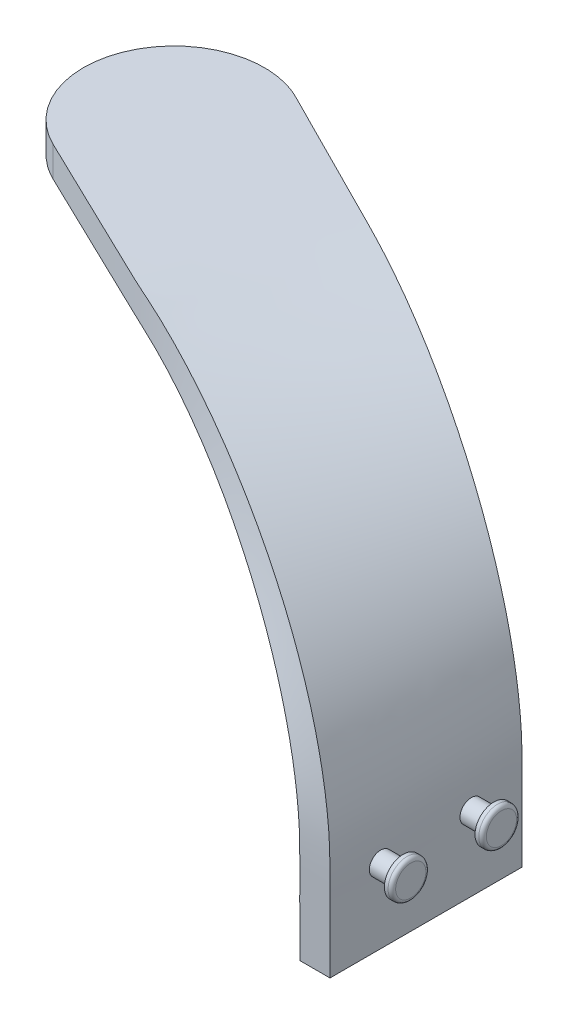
ISO-10303-21;
HEADER;
FILE_DESCRIPTION(('STEP AP214'),'2;1');
FILE_NAME('part.step','',(''),(''),'','','');
FILE_SCHEMA(('AUTOMOTIVE_DESIGN { 1 0 10303 214 1 1 1 1 }'));
ENDSEC;
DATA;
#1=APPLICATION_CONTEXT('core data for automotive mechanical design processes');
#2=APPLICATION_PROTOCOL_DEFINITION('international standard','automotive_design',2000,#1);
#3=PRODUCT_CONTEXT('',#1,'mechanical');
#4=PRODUCT('Part','Part','',(#3));
#5=PRODUCT_RELATED_PRODUCT_CATEGORY('part','',(#4));
#6=PRODUCT_DEFINITION_FORMATION('','',#4);
#7=PRODUCT_DEFINITION_CONTEXT('part definition',#1,'design');
#8=PRODUCT_DEFINITION('design','',#6,#7);
#9=PRODUCT_DEFINITION_SHAPE('','',#8);
#10=(LENGTH_UNIT() NAMED_UNIT(*) SI_UNIT(.MILLI.,.METRE.));
#11=(NAMED_UNIT(*) PLANE_ANGLE_UNIT() SI_UNIT($,.RADIAN.));
#12=(NAMED_UNIT(*) SI_UNIT($,.STERADIAN.) SOLID_ANGLE_UNIT());
#13=UNCERTAINTY_MEASURE_WITH_UNIT(LENGTH_MEASURE(1.E-05),#10,'distance_accuracy_value','');
#14=(GEOMETRIC_REPRESENTATION_CONTEXT(3) GLOBAL_UNCERTAINTY_ASSIGNED_CONTEXT((#13)) GLOBAL_UNIT_ASSIGNED_CONTEXT((#10,
#11,#12)) REPRESENTATION_CONTEXT('',''));
#15=CARTESIAN_POINT('',(0.,0.,0.));
#16=DIRECTION('',(0.,0.,1.));
#17=DIRECTION('',(1.,0.,0.));
#18=AXIS2_PLACEMENT_3D('',#15,#16,#17);
#19=CARTESIAN_POINT('',(-71.076786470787,38.3999952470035,-34.4324435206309));
#20=CARTESIAN_POINT('',(-71.076786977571,38.5333285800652,-34.4324438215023));
#21=CARTESIAN_POINT('',(-71.0767874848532,38.6666619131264,-34.4324441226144));
#22=CARTESIAN_POINT('',(-71.0767930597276,40.133328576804,-34.4324474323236));
#23=CARTESIAN_POINT('',(-71.0767981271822,41.4666619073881,-34.4324504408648));
#24=CARTESIAN_POINT('',(-71.0768037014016,42.9333285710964,-34.4324537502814));
#25=CARTESIAN_POINT('',(-71.0768042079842,43.0666619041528,-34.4324540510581));
#26=CARTESIAN_POINT('',(-71.0768047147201,43.1999952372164,-34.432454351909));
#27=CARTESIAN_POINT('',(-78.3099552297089,38.3999952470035,-37.9253821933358));
#28=CARTESIAN_POINT('',(-78.3099555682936,38.5333285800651,-37.925382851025));
#29=CARTESIAN_POINT('',(-78.3099559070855,38.6666619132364,-37.9253835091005));
#30=CARTESIAN_POINT('',(-78.3099596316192,40.1333285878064,-37.9253907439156));
#31=CARTESIAN_POINT('',(-78.3099630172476,41.4666619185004,-37.9253973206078));
#32=CARTESIAN_POINT('',(-78.3099667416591,42.9333285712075,-37.9254045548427));
#33=CARTESIAN_POINT('',(-78.309967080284,43.0666619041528,-37.9254052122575));
#34=CARTESIAN_POINT('',(-78.3099674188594,43.1999952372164,-37.9254058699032));
#35=CARTESIAN_POINT('',(-84.784714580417,38.3999952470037,-47.7910421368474));
#36=CARTESIAN_POINT('',(-84.7847144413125,38.5333285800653,-47.7910431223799));
#37=CARTESIAN_POINT('',(-84.7847143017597,38.6666619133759,-47.7910441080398));
#38=CARTESIAN_POINT('',(-84.7847127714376,40.1333286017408,-47.791054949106));
#39=CARTESIAN_POINT('',(-84.7847113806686,41.4666619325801,-47.7910648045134));
#40=CARTESIAN_POINT('',(-84.7847098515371,42.933328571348,-47.7910756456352));
#41=CARTESIAN_POINT('',(-84.7847097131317,43.0666619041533,-47.7910766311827));
#42=CARTESIAN_POINT('',(-84.7847095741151,43.1999952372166,-47.7910776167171));
#43=CARTESIAN_POINT('',(-79.4115872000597,38.399995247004,-58.6742511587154));
#44=CARTESIAN_POINT('',(-79.4115865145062,38.5333285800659,-58.6742518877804));
#45=CARTESIAN_POINT('',(-79.4115858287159,38.6666619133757,-58.6742526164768));
#46=CARTESIAN_POINT('',(-79.411578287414,40.1333286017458,-58.6742606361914));
#47=CARTESIAN_POINT('',(-79.4115714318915,41.4666619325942,-58.6742679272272));
#48=CARTESIAN_POINT('',(-79.4115638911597,42.9333285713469,-58.6742759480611));
#49=CARTESIAN_POINT('',(-79.4115632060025,43.0666619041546,-58.6742766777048));
#50=CARTESIAN_POINT('',(-79.4115625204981,43.1999952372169,-58.6742774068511));
#51=CARTESIAN_POINT('',(-67.6422676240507,38.3999952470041,-59.5326633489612));
#52=CARTESIAN_POINT('',(-67.6422668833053,38.5333285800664,-59.532663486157));
#53=CARTESIAN_POINT('',(-67.6422661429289,38.666661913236,-59.5326636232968));
#54=CARTESIAN_POINT('',(-67.6422579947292,40.1333285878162,-59.5326651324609));
#55=CARTESIAN_POINT('',(-67.642250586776,41.4666619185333,-59.5326665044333));
#56=CARTESIAN_POINT('',(-67.6422424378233,42.9333285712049,-59.5326680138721));
#57=CARTESIAN_POINT('',(-67.6422416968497,43.0666619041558,-59.5326681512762));
#58=CARTESIAN_POINT('',(-67.6422409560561,43.199995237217,-59.5326682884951));
#59=CARTESIAN_POINT('',(-60.4711302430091,38.3999952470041,-55.9140808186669));
#60=CARTESIAN_POINT('',(-60.4711296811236,38.5333285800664,-55.9140805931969));
#61=CARTESIAN_POINT('',(-60.4711291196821,38.666661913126,-55.9140803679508));
#62=CARTESIAN_POINT('',(-60.471122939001,40.1333285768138,-55.9140778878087));
#63=CARTESIAN_POINT('',(-60.4711173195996,41.466661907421,-55.9140756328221));
#64=CARTESIAN_POINT('',(-60.4711111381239,42.9333285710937,-55.9140731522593));
#65=CARTESIAN_POINT('',(-60.4711105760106,43.0666619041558,-55.9140729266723));
#66=CARTESIAN_POINT('',(-60.4711100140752,43.199995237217,-55.9140727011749));
#67=(BOUNDED_SURFACE() B_SPLINE_SURFACE(5,3,((#19,#20,#21,#22,#23,#24,#25,#26),(#27,#28,#29,#30,
#31,#32,#33,#34),(#35,#36,#37,#38,#39,#40,#41,#42),(#43,#44,#45,#46,#47,#48,#49,#50),(#51,#52,
#53,#54,#55,#56,#57,#58),(#59,#60,#61,#62,#63,#64,#65,#66)),.UNSPECIFIED.,.F.,.F.,
.F.) B_SPLINE_SURFACE_WITH_KNOTS((6,6),(4,2,2,4),(0.,1.),(-0.100001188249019,
-1.18845291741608E-06,0.999998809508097,1.0999988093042),
.UNSPECIFIED.) GEOMETRIC_REPRESENTATION_ITEM() RATIONAL_B_SPLINE_SURFACE(((1.,1.,1.,1.,1.,1.,1.,
1.),(0.596511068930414,0.596511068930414,0.596511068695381,0.596511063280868,0.596511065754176,
0.596511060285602,0.596511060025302,0.596511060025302),(0.394766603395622,0.394766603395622,
0.394766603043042,0.394766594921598,0.394766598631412,0.394766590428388,0.394766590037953,
0.394766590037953),(0.394766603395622,0.394766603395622,0.394766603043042,0.394766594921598,
0.394766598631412,0.394766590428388,0.394766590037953,0.394766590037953),(0.596511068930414,
0.596511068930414,0.596511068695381,0.596511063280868,0.596511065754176,0.596511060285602,
0.596511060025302,0.596511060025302),(1.,1.,1.,1.,1.,1.,1.,1.))) REPRESENTATION_ITEM('') SURFACE());
#68=CARTESIAN_POINT('',(-60.4711100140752,43.199995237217,-55.9140727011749));
#69=CARTESIAN_POINT('',(-60.4711105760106,43.0666619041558,-55.9140729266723));
#70=CARTESIAN_POINT('',(-60.4711111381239,42.9333285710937,-55.9140731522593));
#71=CARTESIAN_POINT('',(-60.4711173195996,41.466661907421,-55.9140756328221));
#72=CARTESIAN_POINT('',(-60.471122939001,40.1333285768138,-55.9140778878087));
#73=CARTESIAN_POINT('',(-60.4711291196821,38.666661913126,-55.9140803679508));
#74=CARTESIAN_POINT('',(-60.4711296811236,38.5333285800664,-55.9140805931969));
#75=CARTESIAN_POINT('',(-60.4711302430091,38.3999952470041,-55.9140808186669));
#76=(BOUNDED_CURVE() B_SPLINE_CURVE(3,(#68,#69,#70,#71,#72,#73,#74,#75),.UNSPECIFIED.,.F.,
.F.) B_SPLINE_CURVE_WITH_KNOTS((4,2,2,4),(-0.100001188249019,-1.18845291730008E-06,
0.999998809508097,1.0999988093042),
.UNSPECIFIED.) CURVE() GEOMETRIC_REPRESENTATION_ITEM() RATIONAL_B_SPLINE_CURVE((1.,1.,1.,1.,1.,
1.,1.,1.)) REPRESENTATION_ITEM(''));
#77=CARTESIAN_POINT('',(-60.4711117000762,42.7999952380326,-55.914073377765));
#78=VERTEX_POINT('',#77);
#79=CARTESIAN_POINT('',(-60.4711131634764,38.7999952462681,-55.9140723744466));
#80=VERTEX_POINT('',#79);
#81=EDGE_CURVE('E104',#78,#80,#76,.T.);
#82=CARTESIAN_POINT('',(-60.471128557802,38.7999952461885,-55.9140801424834));
#83=CARTESIAN_POINT('',(-60.7719002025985,38.7999936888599,-56.0658912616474));
#84=CARTESIAN_POINT('',(-61.0791023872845,38.799993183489,-56.2049470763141));
#85=CARTESIAN_POINT('',(-61.7041073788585,38.799993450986,-56.4567005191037));
#86=CARTESIAN_POINT('',(-62.0219096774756,38.7999942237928,-56.5693994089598));
#87=CARTESIAN_POINT('',(-62.6656573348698,38.7999962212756,-56.7675364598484));
#88=CARTESIAN_POINT('',(-62.9915968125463,38.7999974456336,-56.8529937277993));
#89=CARTESIAN_POINT('',(-63.6495097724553,38.7999994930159,-56.9961581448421));
#90=CARTESIAN_POINT('',(-63.9814831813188,38.8000003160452,-57.0538656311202));
#91=CARTESIAN_POINT('',(-64.6492680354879,38.8000013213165,-57.1411397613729));
#92=CARTESIAN_POINT('',(-64.985081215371,38.8000015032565,-57.170693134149));
#93=CARTESIAN_POINT('',(-65.6580034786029,38.8000015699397,-57.201402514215));
#94=CARTESIAN_POINT('',(-65.9951125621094,38.8000014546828,-57.2025585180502));
#95=CARTESIAN_POINT('',(-66.6681640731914,38.8000011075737,-57.1764672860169));
#96=CARTESIAN_POINT('',(-67.0041067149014,38.8000008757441,-57.1492255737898));
#97=CARTESIAN_POINT('',(-67.6725018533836,38.8000004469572,-57.0665413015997));
#98=CARTESIAN_POINT('',(-68.0049543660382,38.8000002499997,-57.0110988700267));
#99=CARTESIAN_POINT('',(-68.6640154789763,38.7999999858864,-56.8724056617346));
#100=CARTESIAN_POINT('',(-68.9906239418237,38.7999999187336,-56.7891542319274));
#101=CARTESIAN_POINT('',(-69.6356678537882,38.7999998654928,-56.5954349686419));
#102=CARTESIAN_POINT('',(-69.9541032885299,38.7999998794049,-56.484967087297));
#103=CARTESIAN_POINT('',(-70.5805846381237,38.7999999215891,-56.2375814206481));
#104=CARTESIAN_POINT('',(-70.8886289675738,38.7999999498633,-56.1006596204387));
#105=CARTESIAN_POINT('',(-71.492086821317,38.7999999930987,-55.8013505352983));
#106=CARTESIAN_POINT('',(-71.7875003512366,38.8000000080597,-55.6389632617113));
#107=CARTESIAN_POINT('',(-72.3635835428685,38.8000000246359,-55.2898855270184));
#108=CARTESIAN_POINT('',(-72.6442538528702,38.8000000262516,-55.1031961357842));
#109=CARTESIAN_POINT('',(-73.1888690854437,38.8000000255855,-54.7068359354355));
#110=CARTESIAN_POINT('',(-73.4528140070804,38.8000000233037,-54.4971651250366));
#111=CARTESIAN_POINT('',(-73.9620854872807,38.8000000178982,-54.0563469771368));
#112=CARTESIAN_POINT('',(-74.2074132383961,38.8000000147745,-53.8252010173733));
#113=CARTESIAN_POINT('',(-74.6777250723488,38.8000000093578,-53.3430644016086));
#114=CARTESIAN_POINT('',(-74.9027091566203,38.8000000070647,-53.0920737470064));
#115=CARTESIAN_POINT('',(-75.3307386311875,38.8000000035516,-52.5720267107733));
#116=CARTESIAN_POINT('',(-75.5337835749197,38.8000000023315,-52.3029699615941));
#117=CARTESIAN_POINT('',(-75.916486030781,38.8000000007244,-51.7487080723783));
#118=CARTESIAN_POINT('',(-76.0961435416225,38.8000000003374,-51.4635029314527));
#119=CARTESIAN_POINT('',(-76.4307978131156,38.799999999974,-50.878965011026));
#120=CARTESIAN_POINT('',(-76.5857939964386,38.7999999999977,-50.5796319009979));
#121=CARTESIAN_POINT('',(-76.8700185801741,38.800000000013,-49.9689723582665));
#122=CARTESIAN_POINT('',(-76.9992469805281,38.8000000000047,-49.6576459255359));
#123=CARTESIAN_POINT('',(-77.2310162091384,38.7999999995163,-49.0252159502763));
#124=CARTESIAN_POINT('',(-77.3335572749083,38.7999999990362,-48.7041124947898));
#125=CARTESIAN_POINT('',(-77.5112243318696,38.7999999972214,-48.0544086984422));
#126=CARTESIAN_POINT('',(-77.586350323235,38.7999999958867,-47.7258083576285));
#127=CARTESIAN_POINT('',(-77.7086527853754,38.7999999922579,-47.0634488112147));
#128=CARTESIAN_POINT('',(-77.7558294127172,38.7999999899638,-46.729689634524));
#129=CARTESIAN_POINT('',(-77.82189840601,38.7999999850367,-46.0593834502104));
#130=CARTESIAN_POINT('',(-77.8407907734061,38.7999999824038,-45.7228364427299));
#131=CARTESIAN_POINT('',(-77.8501570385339,38.7999999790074,-45.0493399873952));
#132=CARTESIAN_POINT('',(-77.8406303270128,38.799999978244,-44.7123905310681));
#133=CARTESIAN_POINT('',(-77.7932248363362,38.7999999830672,-44.0404918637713));
#134=CARTESIAN_POINT('',(-77.7553460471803,38.7999999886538,-43.7055426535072));
#135=CARTESIAN_POINT('',(-77.6515076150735,38.8000000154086,-43.0400382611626));
#136=CARTESIAN_POINT('',(-77.5855490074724,38.8000000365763,-42.7094829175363));
#137=CARTESIAN_POINT('',(-77.4260201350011,38.800000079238,-42.0551041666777));
#138=CARTESIAN_POINT('',(-77.3324499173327,38.8000001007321,-41.7312807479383));
#139=CARTESIAN_POINT('',(-77.1183756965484,38.8000001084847,-41.0927052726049));
#140=CARTESIAN_POINT('',(-76.9978748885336,38.8000000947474,-40.7779521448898));
#141=CARTESIAN_POINT('',(-76.7307887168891,38.7999999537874,-40.1597121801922));
#142=CARTESIAN_POINT('',(-76.5842031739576,38.7999998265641,-39.8562254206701));
#143=CARTESIAN_POINT('',(-76.2659453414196,38.799999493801,-39.2625943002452));
#144=CARTESIAN_POINT('',(-76.0942660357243,38.7999992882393,-38.9724537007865));
#145=CARTESIAN_POINT('',(-75.727077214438,38.7999989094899,-38.4076768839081));
#146=CARTESIAN_POINT('',(-75.5315683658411,38.7999987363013,-38.1330402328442));
#147=CARTESIAN_POINT('',(-75.1179916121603,38.7999985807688,-37.6010668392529));
#148=CARTESIAN_POINT('',(-74.8999111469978,38.7999985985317,-37.3437398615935));
#149=CARTESIAN_POINT('',(-74.4428334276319,38.7999990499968,-36.8483861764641));
#150=CARTESIAN_POINT('',(-74.2038362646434,38.7999994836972,-36.6103593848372));
#151=CARTESIAN_POINT('',(-73.7069132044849,38.8000009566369,-36.1555601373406));
#152=CARTESIAN_POINT('',(-73.4490089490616,38.800001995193,-35.9387640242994));
#153=CARTESIAN_POINT('',(-72.9159614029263,38.8000040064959,-35.5277396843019));
#154=CARTESIAN_POINT('',(-72.6408259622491,38.8000049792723,-35.3335012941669));
#155=CARTESIAN_POINT('',(-72.1519245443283,38.8000059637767,-35.0183359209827));
#156=CARTESIAN_POINT('',(-71.9417432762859,38.8000061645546,-34.8918101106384));
#157=CARTESIAN_POINT('',(-71.5143922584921,38.8000058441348,-34.6520997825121));
#158=CARTESIAN_POINT('',(-71.2972354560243,38.8000053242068,-34.5388921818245));
#159=CARTESIAN_POINT('',(-71.0767879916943,38.800004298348,-34.4324444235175));
#160=B_SPLINE_CURVE_WITH_KNOTS('',3,(#82,#83,#84,#85,#86,#87,#88,#89,#90,#91,#92,#93,#94,#95,
#96,#97,#98,#99,#100,#101,#102,#103,#104,#105,#106,#107,#108,#109,#110,#111,#112,#113,#114,#115,
#116,#117,#118,#119,#120,#121,#122,#123,#124,#125,#126,#127,#128,#129,#130,#131,#132,#133,#134,
#135,#136,#137,#138,#139,#140,#141,#142,#143,#144,#145,#146,#147,#148,#149,#150,#151,#152,#153,
#154,#155,#156,#157,#158,#159),.UNSPECIFIED.,.F.,.F.,(4,2,2,2,2,2,2,2,2,2,2,2,2,2,2,2,2,2,2,2,2,
2,2,2,2,2,2,2,2,2,2,2,2,2,2,2,2,2,4),(0.,1.01042972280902,2.02081106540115,3.03048217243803,
4.0401410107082,5.0502755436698,6.06041019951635,7.07034841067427,8.08028202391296,
9.0902393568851,10.1001984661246,11.1103109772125,12.1204230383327,13.1304906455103,
14.1405583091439,15.1505612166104,16.1605640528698,17.1705874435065,18.1806108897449,
19.1906579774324,20.2007050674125,21.2107431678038,22.220781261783,23.2308136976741,
24.240846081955,25.2509001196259,26.2609545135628,27.2709716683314,28.2809870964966,
29.2908827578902,30.300785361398,31.3109708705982,32.3211281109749,33.3318505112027,
34.342568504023,35.3521471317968,36.3612691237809,37.0968085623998,37.8310537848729),.UNSPECIFIED.);
#161=CARTESIAN_POINT('',(-71.0767879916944,38.800004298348,-34.4324444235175));
#162=VERTEX_POINT('',#161);
#163=EDGE_CURVE('E88',#80,#162,#160,.T.);
#164=CARTESIAN_POINT('',(-71.076786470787,38.3999952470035,-34.4324435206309));
#165=CARTESIAN_POINT('',(-71.076786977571,38.5333285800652,-34.4324438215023));
#166=CARTESIAN_POINT('',(-71.0767874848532,38.6666619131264,-34.4324441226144));
#167=CARTESIAN_POINT('',(-71.0767930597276,40.133328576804,-34.4324474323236));
#168=CARTESIAN_POINT('',(-71.0767981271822,41.4666619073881,-34.4324504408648));
#169=CARTESIAN_POINT('',(-71.0768037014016,42.9333285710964,-34.4324537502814));
#170=CARTESIAN_POINT('',(-71.0768042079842,43.0666619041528,-34.4324540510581));
#171=CARTESIAN_POINT('',(-71.0768047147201,43.1999952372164,-34.432454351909));
#172=(BOUNDED_CURVE() B_SPLINE_CURVE(3,(#164,#165,#166,#167,#168,#169,#170,#171),.UNSPECIFIED.,
.F.,.F.) B_SPLINE_CURVE_WITH_KNOTS((4,2,2,4),(-0.100001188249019,-1.18845291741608E-06,
0.999998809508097,1.0999988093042),
.UNSPECIFIED.) CURVE() GEOMETRIC_REPRESENTATION_ITEM() RATIONAL_B_SPLINE_CURVE((1.,1.,1.,1.,1.,
1.,1.,1.)) REPRESENTATION_ITEM(''));
#173=CARTESIAN_POINT('',(-71.0768031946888,42.8000042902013,-34.4324534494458));
#174=VERTEX_POINT('',#173);
#175=EDGE_CURVE('E300',#162,#174,#172,.T.);
#176=CARTESIAN_POINT('',(-71.0768031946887,42.8000042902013,-34.4324534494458));
#177=CARTESIAN_POINT('',(-71.3802085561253,42.8000056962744,-34.5789300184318));
#178=CARTESIAN_POINT('',(-71.6773974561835,42.800006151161,-34.7382675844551));
#179=CARTESIAN_POINT('',(-72.2572949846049,42.8000059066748,-35.081385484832));
#180=CARTESIAN_POINT('',(-72.5400043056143,42.8000052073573,-35.2651646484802));
#181=CARTESIAN_POINT('',(-73.0887318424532,42.8000034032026,-35.6557634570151));
#182=CARTESIAN_POINT('',(-73.3547616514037,42.8000022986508,-35.8625668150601));
#183=CARTESIAN_POINT('',(-73.8684592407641,42.800000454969,-36.2978371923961));
#184=CARTESIAN_POINT('',(-74.1161272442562,42.7999997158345,-36.5263039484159));
#185=CARTESIAN_POINT('',(-74.5914557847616,42.7999988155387,-37.003395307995));
#186=CARTESIAN_POINT('',(-74.8191068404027,42.7999986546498,-37.2520293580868));
#187=CARTESIAN_POINT('',(-75.2526521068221,42.7999985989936,-37.7675930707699));
#188=CARTESIAN_POINT('',(-75.4585463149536,42.7999987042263,-38.0345227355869));
#189=CARTESIAN_POINT('',(-75.8470758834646,42.7999990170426,-38.5847262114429));
#190=CARTESIAN_POINT('',(-76.0297157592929,42.7999992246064,-38.8679968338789));
#191=CARTESIAN_POINT('',(-76.3704845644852,42.7999996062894,-39.4489145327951));
#192=CARTESIAN_POINT('',(-76.5286136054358,42.7999997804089,-39.746561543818));
#193=CARTESIAN_POINT('',(-76.8192411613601,42.8000000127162,-40.3541246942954));
#194=CARTESIAN_POINT('',(-76.9517390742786,42.8000000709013,-40.664041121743));
#195=CARTESIAN_POINT('',(-77.1901581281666,42.8000001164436,-41.2939340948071));
#196=CARTESIAN_POINT('',(-77.2960792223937,42.8000001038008,-41.6139106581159));
#197=CARTESIAN_POINT('',(-77.4806054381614,42.8000000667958,-42.2616981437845));
#198=CARTESIAN_POINT('',(-77.559206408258,42.800000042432,-42.5895102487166));
#199=CARTESIAN_POINT('',(-77.6885111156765,42.8000000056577,-43.250590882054));
#200=CARTESIAN_POINT('',(-77.7392148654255,42.7999999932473,-43.5838594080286));
#201=CARTESIAN_POINT('',(-77.8123630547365,42.799999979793,-44.2534685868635));
#202=CARTESIAN_POINT('',(-77.834808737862,42.7999999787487,-44.5898091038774));
#203=CARTESIAN_POINT('',(-77.8512853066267,42.7999999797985,-45.2631854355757));
#204=CARTESIAN_POINT('',(-77.8453161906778,42.7999999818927,-45.6002212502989));
#205=CARTESIAN_POINT('',(-77.8050068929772,42.7999999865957,-46.2725702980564));
#206=CARTESIAN_POINT('',(-77.7706685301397,42.7999999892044,-46.6078836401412));
#207=CARTESIAN_POINT('',(-77.6738671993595,42.7999999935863,-47.2744257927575));
#208=CARTESIAN_POINT('',(-77.6114042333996,42.7999999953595,-47.6056546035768));
#209=CARTESIAN_POINT('',(-77.4587961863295,42.7999999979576,-48.2616797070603));
#210=CARTESIAN_POINT('',(-77.3686505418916,42.7999999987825,-48.5864758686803));
#211=CARTESIAN_POINT('',(-77.1613184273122,42.7999999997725,-49.2273196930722));
#212=CARTESIAN_POINT('',(-77.0441319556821,42.7999999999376,-49.5433673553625));
#213=CARTESIAN_POINT('',(-76.7835482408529,42.8000000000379,-50.1644745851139));
#214=CARTESIAN_POINT('',(-76.6401503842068,42.799999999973,-50.4695338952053));
#215=CARTESIAN_POINT('',(-76.3281652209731,42.8000000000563,-51.066487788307));
#216=CARTESIAN_POINT('',(-76.1595779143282,42.8000000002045,-51.3583823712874));
#217=CARTESIAN_POINT('',(-75.7984140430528,42.8000000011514,-51.9269290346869));
#218=CARTESIAN_POINT('',(-75.6058376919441,42.8000000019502,-52.2035812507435));
#219=CARTESIAN_POINT('',(-75.1980636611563,42.8000000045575,-52.7396791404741));
#220=CARTESIAN_POINT('',(-74.9828659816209,42.800000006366,-52.9991248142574));
#221=CARTESIAN_POINT('',(-74.5313804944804,42.8000000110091,-53.4989637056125));
#222=CARTESIAN_POINT('',(-74.295092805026,42.8000000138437,-53.7393570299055));
#223=CARTESIAN_POINT('',(-73.8031061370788,42.8000000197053,-54.1993837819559));
#224=CARTESIAN_POINT('',(-73.5474071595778,42.8000000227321,-54.4190172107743));
#225=CARTESIAN_POINT('',(-73.018410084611,42.8000000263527,-54.8359672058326));
#226=CARTESIAN_POINT('',(-72.7451116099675,42.8000000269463,-55.033283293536));
#227=CARTESIAN_POINT('',(-72.1828634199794,42.8000000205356,-55.404190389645));
#228=CARTESIAN_POINT('',(-71.8939136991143,42.8000000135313,-55.5777813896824));
#229=CARTESIAN_POINT('',(-71.3024283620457,42.7999999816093,-55.8999981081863));
#230=CARTESIAN_POINT('',(-70.9998932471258,42.7999999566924,-56.0486247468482));
#231=CARTESIAN_POINT('',(-70.3833784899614,42.7999999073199,-56.3198636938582));
#232=CARTESIAN_POINT('',(-70.069398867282,42.7999998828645,-56.4424760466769));
#233=CARTESIAN_POINT('',(-69.4322645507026,42.7999998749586,-56.6608021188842));
#234=CARTESIAN_POINT('',(-69.1091109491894,42.7999998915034,-56.7565190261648));
#235=CARTESIAN_POINT('',(-68.4558876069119,42.8000000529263,-56.9203938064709));
#236=CARTESIAN_POINT('',(-68.1258178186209,42.8000001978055,-56.9885514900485));
#237=CARTESIAN_POINT('',(-67.4610170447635,42.8000005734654,-57.0968376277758));
#238=CARTESIAN_POINT('',(-67.1262847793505,42.8000008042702,-57.1369582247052));
#239=CARTESIAN_POINT('',(-66.454639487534,42.8000012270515,-57.1888531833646));
#240=CARTESIAN_POINT('',(-66.1177265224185,42.800001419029,-57.2006283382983));
#241=CARTESIAN_POINT('',(-65.4439182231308,42.800001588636,-57.1957498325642));
#242=CARTESIAN_POINT('',(-65.1070230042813,42.8000015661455,-57.1790802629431));
#243=CARTESIAN_POINT('',(-64.4358368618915,42.8000010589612,-57.1173998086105));
#244=CARTESIAN_POINT('',(-64.1015459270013,42.8000005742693,-57.0723890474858));
#245=CARTESIAN_POINT('',(-63.4383285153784,42.799998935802,-56.9544163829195));
#246=CARTESIAN_POINT('',(-63.1093964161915,42.7999977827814,-56.8814860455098));
#247=CARTESIAN_POINT('',(-62.4589669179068,42.7999955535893,-56.7082169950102));
#248=CARTESIAN_POINT('',(-62.1374662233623,42.7999944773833,-56.6078906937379));
#249=CARTESIAN_POINT('',(-61.5899822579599,42.7999933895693,-56.411383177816));
#250=CARTESIAN_POINT('',(-61.3617337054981,42.7999931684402,-56.3214521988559));
#251=CARTESIAN_POINT('',(-60.911579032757,42.7999935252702,-56.1279299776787));
#252=CARTESIAN_POINT('',(-60.6896624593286,42.799994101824,-56.0243630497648));
#253=CARTESIAN_POINT('',(-60.4711117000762,42.7999952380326,-55.914073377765));
#254=B_SPLINE_CURVE_WITH_KNOTS('',3,(#176,#177,#178,#179,#180,#181,#182,#183,#184,#185,#186,
#187,#188,#189,#190,#191,#192,#193,#194,#195,#196,#197,#198,#199,#200,#201,#202,#203,#204,#205,
#206,#207,#208,#209,#210,#211,#212,#213,#214,#215,#216,#217,#218,#219,#220,#221,#222,#223,#224,
#225,#226,#227,#228,#229,#230,#231,#232,#233,#234,#235,#236,#237,#238,#239,#240,#241,#242,#243,
#244,#245,#246,#247,#248,#249,#250,#251,#252,#253),.UNSPECIFIED.,.F.,.F.,(4,2,2,2,2,2,2,2,2,2,2,
2,2,2,2,2,2,2,2,2,2,2,2,2,2,2,2,2,2,2,2,2,2,2,2,2,2,2,4),(0.,1.01042972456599,2.02081106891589,
3.03048217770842,4.04014101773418,5.05027555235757,6.06041020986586,7.07034842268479,
8.08028203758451,9.09023937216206,10.1001984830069,11.1103109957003,12.120423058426,
13.1304906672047,14.1405583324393,15.1505612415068,16.160564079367,17.1705874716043,
18.1806109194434,19.1906580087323,20.2007051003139,21.210743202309,22.220781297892,
23.2308137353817,24.2408461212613,25.2509001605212,26.2609545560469,27.2709717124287,
28.2809871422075,29.2908828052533,30.3007854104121,31.3109709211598,32.3211281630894,
33.3318505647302,34.3425685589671,35.3521471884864,36.3612691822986,37.0968088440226,
37.831054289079),.UNSPECIFIED.);
#255=EDGE_CURVE('E172',#174,#78,#254,.T.);
#256=ORIENTED_EDGE('',*,*,#81,.T.);
#257=ORIENTED_EDGE('',*,*,#163,.T.);
#258=ORIENTED_EDGE('',*,*,#175,.T.);
#259=ORIENTED_EDGE('',*,*,#255,.T.);
#260=EDGE_LOOP('',(#256,#257,#258,#259));
#261=FACE_BOUND('',#260,.T.);
#262=ADVANCED_FACE('F38',(#261),#67,.F.);
#263=CARTESIAN_POINT('',(-4.00000000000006,0.,0.));
#264=DIRECTION('',(0.,-1.,0.));
#265=DIRECTION('',(0.,0.,1.));
#266=AXIS2_PLACEMENT_3D('',#263,#264,#265);
#267=PLANE('',#266);
#268=DIRECTION('',(0.,0.,-1.));
#269=VECTOR('',#268,1.);
#270=CARTESIAN_POINT('',(-4.00000000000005,0.,-25.3999999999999));
#271=LINE('',#270,#269);
#272=CARTESIAN_POINT('',(-4.00000000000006,0.,0.));
#273=VERTEX_POINT('',#272);
#274=CARTESIAN_POINT('',(-4.00000000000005,0.,-25.3999999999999));
#275=VERTEX_POINT('',#274);
#276=EDGE_CURVE('E85',#273,#275,#271,.T.);
#277=ORIENTED_EDGE('',*,*,#276,.T.);
#278=DIRECTION('',(1.,0.,0.));
#279=VECTOR('',#278,1.);
#280=CARTESIAN_POINT('',(-4.00000000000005,0.,-25.3999999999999));
#281=LINE('',#280,#279);
#282=CARTESIAN_POINT('',(0.,0.,-25.3999999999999));
#283=VERTEX_POINT('',#282);
#284=EDGE_CURVE('E96',#275,#283,#281,.T.);
#285=ORIENTED_EDGE('',*,*,#284,.T.);
#286=DIRECTION('',(0.,0.,1.));
#287=VECTOR('',#286,1.);
#288=CARTESIAN_POINT('',(0.,0.,-25.3999999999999));
#289=LINE('',#288,#287);
#290=CARTESIAN_POINT('',(0.,0.,0.));
#291=VERTEX_POINT('',#290);
#292=EDGE_CURVE('E105',#283,#291,#289,.T.);
#293=ORIENTED_EDGE('',*,*,#292,.T.);
#294=DIRECTION('',(-1.,0.,0.));
#295=VECTOR('',#294,1.);
#296=CARTESIAN_POINT('',(-4.00000000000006,0.,0.));
#297=LINE('',#296,#295);
#298=EDGE_CURVE('E112',#291,#273,#297,.T.);
#299=ORIENTED_EDGE('',*,*,#298,.T.);
#300=EDGE_LOOP('',(#277,#285,#293,#299));
#301=FACE_BOUND('',#300,.T.);
#302=ADVANCED_FACE('F111',(#301),#267,.T.);
#303=CARTESIAN_POINT('',(0.,0.,-25.3999999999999));
#304=CARTESIAN_POINT('',(-5.71687791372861E-05,0.704859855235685,-25.4000288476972));
#305=CARTESIAN_POINT('',(-0.000171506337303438,2.11457956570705,-25.4000865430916));
#306=CARTESIAN_POINT('',(0.000971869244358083,4.95071579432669,-25.3995095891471));
#307=CARTESIAN_POINT('',(-0.00788929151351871,8.37066002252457,-25.4039809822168));
#308=CARTESIAN_POINT('',(0.023219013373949,12.3373270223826,-25.388283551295));
#309=CARTESIAN_POINT('',(-0.0441797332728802,14.4691929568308,-25.4222933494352));
#310=CARTESIAN_POINT('',(-0.210788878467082,15.8228707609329,-25.506365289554));
#311=CARTESIAN_POINT('',(-0.421178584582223,17.0419748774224,-25.6125291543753));
#312=CARTESIAN_POINT('',(-0.687205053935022,18.2813288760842,-25.7467676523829));
#313=CARTESIAN_POINT('',(-1.13670477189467,19.8000146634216,-25.9735878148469));
#314=CARTESIAN_POINT('',(-1.60167497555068,21.0532573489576,-26.2082144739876));
#315=CARTESIAN_POINT('',(-2.11964339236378,22.2906355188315,-26.4695843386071));
#316=CARTESIAN_POINT('',(-2.84660320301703,23.7860282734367,-26.8364124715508));
#317=CARTESIAN_POINT('',(-3.69885039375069,25.2265068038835,-27.2664613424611));
#318=CARTESIAN_POINT('',(-4.51070310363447,26.443898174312,-27.6761269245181));
#319=CARTESIAN_POINT('',(-5.83432504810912,28.2711282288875,-28.3440342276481));
#320=CARTESIAN_POINT('',(-7.35476279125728,29.971392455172,-29.1112559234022));
#321=CARTESIAN_POINT('',(-9.05115335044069,31.581941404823,-29.9672644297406));
#322=CARTESIAN_POINT('',(-10.8862404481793,33.2058686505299,-30.8932600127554));
#323=CARTESIAN_POINT('',(-12.9235378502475,34.6947981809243,-31.9212920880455));
#324=CARTESIAN_POINT('',(-14.7747762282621,35.8486442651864,-32.8554377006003));
#325=CARTESIAN_POINT('',(-15.5044324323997,36.2841425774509,-33.2236264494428));
#326=CARTESIAN_POINT('',(-17.4746413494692,37.4090379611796,-34.2178052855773));
#327=CARTESIAN_POINT('',(-19.6713811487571,38.4596413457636,-35.3262929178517));
#328=CARTESIAN_POINT('',(-22.0903846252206,39.4219204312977,-36.5469360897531));
#329=CARTESIAN_POINT('',(-24.5540147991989,40.3248636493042,-37.7900981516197));
#330=CARTESIAN_POINT('',(-27.11075342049,41.0665018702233,-39.0802432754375));
#331=CARTESIAN_POINT('',(-29.6638284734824,41.6380411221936,-40.3685397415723));
#332=CARTESIAN_POINT('',(-32.1868482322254,42.1380249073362,-41.6416701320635));
#333=CARTESIAN_POINT('',(-34.7203599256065,42.4841001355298,-42.920094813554));
#334=CARTESIAN_POINT('',(-37.2813916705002,42.6827120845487,-44.2124062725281));
#335=CARTESIAN_POINT('',(-38.9008165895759,42.7737788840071,-45.0295774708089));
#336=CARTESIAN_POINT('',(-41.4075422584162,42.81414078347,-46.2944857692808));
#337=CARTESIAN_POINT('',(-44.7588753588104,42.7954564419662,-47.985587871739));
#338=CARTESIAN_POINT('',(-48.5394052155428,42.8011799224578,-49.893265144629));
#339=CARTESIAN_POINT('',(-52.3185347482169,42.7996823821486,-51.8002358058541));
#340=CARTESIAN_POINT('',(-56.0766329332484,42.8000857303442,-53.6965939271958));
#341=CARTESIAN_POINT('',(-59.8560317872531,42.7999769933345,-55.603700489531));
#342=CARTESIAN_POINT('',(-63.6354574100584,42.800006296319,-57.5108205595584));
#343=CARTESIAN_POINT('',(-66.7958164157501,42.7999992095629,-59.105556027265));
#344=CARTESIAN_POINT('',(-69.3371174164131,42.8000001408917,-60.3879112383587));
#345=CARTESIAN_POINT('',(-70.6186115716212,42.800000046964,-61.0345606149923));
#346=CARTESIAN_POINT('',(-71.2593586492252,42.8000000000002,-61.3578853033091));
#347=CARTESIAN_POINT('',(0.,0.,0.));
#348=CARTESIAN_POINT('',(-0.00018284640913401,0.706909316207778,-8.96502118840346E-05));
#349=CARTESIAN_POINT('',(-0.000548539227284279,2.12072794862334,-0.000268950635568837));
#350=CARTESIAN_POINT('',(0.00310838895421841,4.9158749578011,0.00152405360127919));
#351=CARTESIAN_POINT('',(-0.0252328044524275,8.65348563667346,-0.012371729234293));
#352=CARTESIAN_POINT('',(0.074262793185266,11.5049415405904,0.0364112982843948));
#353=CARTESIAN_POINT('',(-0.141302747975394,16.0530056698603,-0.069281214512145));
#354=CARTESIAN_POINT('',(-0.647378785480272,18.3046227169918,-0.317320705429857));
#355=CARTESIAN_POINT('',(-1.25179617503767,20.349819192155,-0.613435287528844));
#356=CARTESIAN_POINT('',(-1.98844085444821,22.3289794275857,-0.974225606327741));
#357=CARTESIAN_POINT('',(-3.11068447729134,24.5326023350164,-1.52339091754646));
#358=CARTESIAN_POINT('',(-4.16941378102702,26.2054074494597,-2.04103000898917));
#359=CARTESIAN_POINT('',(-5.28666738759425,27.7716463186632,-2.58698568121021));
#360=CARTESIAN_POINT('',(-6.7380045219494,29.5164193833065,-3.29560462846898));
#361=CARTESIAN_POINT('',(-8.27023008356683,31.0435416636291,-4.04279390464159));
#362=CARTESIAN_POINT('',(-9.64364195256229,32.2632516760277,-4.71201539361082));
#363=CARTESIAN_POINT('',(-11.7896358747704,34.0114709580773,-5.75709229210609));
#364=CARTESIAN_POINT('',(-14.0035548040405,35.4621911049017,-6.83355999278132));
#365=CARTESIAN_POINT('',(-16.3164531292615,36.7576232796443,-7.9569776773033));
#366=CARTESIAN_POINT('',(-18.7506192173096,38.018654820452,-9.13875527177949));
#367=CARTESIAN_POINT('',(-21.2762354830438,39.0810674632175,-10.3634795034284));
#368=CARTESIAN_POINT('',(-23.4828315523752,39.8599603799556,-11.4327275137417));
#369=CARTESIAN_POINT('',(-24.3437719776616,40.1480585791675,-11.8498322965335));
#370=CARTESIAN_POINT('',(-26.644966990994,40.8768537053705,-12.9644884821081));
#371=CARTESIAN_POINT('',(-29.1215643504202,41.5038737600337,-14.1632743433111));
#372=CARTESIAN_POINT('',(-31.7830405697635,42.0272543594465,-15.4509150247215));
#373=CARTESIAN_POINT('',(-34.4670786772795,42.4910676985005,-16.7492084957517));
#374=CARTESIAN_POINT('',(-37.1889674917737,42.8057707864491,-18.0651747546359));
#375=CARTESIAN_POINT('',(-39.8637626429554,42.9779454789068,-19.3579303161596));
#376=CARTESIAN_POINT('',(-42.4905252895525,43.0907850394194,-20.6272992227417));
#377=CARTESIAN_POINT('',(-45.0893448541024,43.0778020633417,-21.8827580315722));
#378=CARTESIAN_POINT('',(-47.6881840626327,42.921918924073,-23.137926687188));
#379=CARTESIAN_POINT('',(-49.31896903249,42.82362339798,-23.9254167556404));
#380=CARTESIAN_POINT('',(-51.8488433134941,42.7872601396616,-25.1471284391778));
#381=CARTESIAN_POINT('',(-55.2284879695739,42.8040934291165,-26.7791776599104));
#382=CARTESIAN_POINT('',(-59.0419279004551,42.7989369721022,-28.6207195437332));
#383=CARTESIAN_POINT('',(-62.8536933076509,42.800286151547,-30.4614499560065));
#384=CARTESIAN_POINT('',(-66.6443144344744,42.7999227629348,-32.2919703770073));
#385=CARTESIAN_POINT('',(-70.456401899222,42.800020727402,-34.1328568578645));
#386=CARTESIAN_POINT('',(-74.2685213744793,42.7999943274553,-35.9737588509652));
#387=CARTESIAN_POINT('',(-77.4562178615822,42.8000007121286,-37.5131221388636));
#388=CARTESIAN_POINT('',(-80.0195016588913,42.7999998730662,-38.7509517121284));
#389=CARTESIAN_POINT('',(-81.3120809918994,42.7999999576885,-39.3751482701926));
#390=CARTESIAN_POINT('',(-81.9583706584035,42.7999999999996,-39.6872465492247));
#391=B_SPLINE_SURFACE_WITH_KNOTS('',1,3,((#303,#304,#305,#306,#307,#308,#309,#310,#311,#312,
#313,#314,#315,#316,#317,#318,#319,#320,#321,#322,#323,#324,#325,#326,#327,#328,#329,#330,#331,
#332,#333,#334,#335,#336,#337,#338,#339,#340,#341,#342,#343,#344,#345,#346),(#347,#348,#349,
#350,#351,#352,#353,#354,#355,#356,#357,#358,#359,#360,#361,#362,#363,#364,#365,#366,#367,#368,
#369,#370,#371,#372,#373,#374,#375,#376,#377,#378,#379,#380,#381,#382,#383,#384,#385,#386,#387,
#388,#389,#390)),.UNSPECIFIED.,.F.,.F.,.F.,(2,2),(4,1,1,1,1,1,1,1,1,1,1,1,1,1,1,1,1,1,1,1,1,1,1,
1,1,1,1,1,1,1,1,1,1,1,1,1,1,1,1,1,1,4),(0.,1.),(0.,0.0193096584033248,0.0386193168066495,
0.0772386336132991,0.115857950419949,0.136818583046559,0.158030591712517,0.16186637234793,
0.179139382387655,0.200689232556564,0.213770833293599,0.222155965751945,0.243388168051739,
0.265741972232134,0.273639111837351,0.288118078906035,0.334305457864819,0.341844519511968,
0.358232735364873,0.40761615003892,0.416949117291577,0.423419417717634,0.433008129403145,
0.484752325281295,0.496061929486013,0.5109262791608,0.563296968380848,0.575655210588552,
0.589278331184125,0.640271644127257,0.652399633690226,0.665432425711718,0.690383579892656,
0.729002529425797,0.768277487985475,0.806240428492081,0.844859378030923,0.883478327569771,
0.922097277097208,0.960716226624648,0.980358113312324,1.),.UNSPECIFIED.);
#392=CARTESIAN_POINT('',(0.0159484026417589,9.83119500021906,-5.18935855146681));
#393=CARTESIAN_POINT('',(0.0168974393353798,9.91545331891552,-5.18936432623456));
#394=CARTESIAN_POINT('',(0.0177856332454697,9.99980013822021,-5.19649147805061));
#395=CARTESIAN_POINT('',(0.0189702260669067,10.1244439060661,-5.21769492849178));
#396=CARTESIAN_POINT('',(0.0193407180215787,10.1657122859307,-5.22652647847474));
#397=CARTESIAN_POINT('',(0.0200276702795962,10.2474001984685,-5.24763971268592));
#398=CARTESIAN_POINT('',(0.0203440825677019,10.2878189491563,-5.25992443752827));
#399=CARTESIAN_POINT('',(0.0212044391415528,10.407199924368,-5.30180160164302));
#400=CARTESIAN_POINT('',(0.0216610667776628,10.4844499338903,-5.33644494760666));
#401=CARTESIAN_POINT('',(0.0223407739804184,10.6320302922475,-5.41822528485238));
#402=CARTESIAN_POINT('',(0.0225638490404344,10.7023605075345,-5.46536251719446));
#403=CARTESIAN_POINT('',(0.0227527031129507,10.8011383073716,-5.54437144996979));
#404=CARTESIAN_POINT('',(0.0227913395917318,10.8329626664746,-5.57211180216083));
#405=CARTESIAN_POINT('',(0.022827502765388,10.8941341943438,-5.63014351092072));
#406=CARTESIAN_POINT('',(0.0228250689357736,10.9234837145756,-5.66043239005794));
#407=CARTESIAN_POINT('',(0.0227681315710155,11.0075602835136,-5.75487653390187));
#408=CARTESIAN_POINT('',(0.0226640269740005,11.0583398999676,-5.82262898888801));
#409=CARTESIAN_POINT('',(0.022394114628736,11.1477788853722,-5.96566549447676));
#410=CARTESIAN_POINT('',(0.0222283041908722,11.1864377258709,-6.04094987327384));
#411=CARTESIAN_POINT('',(0.0219000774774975,11.2505755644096,-6.19694920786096));
#412=CARTESIAN_POINT('',(0.0217376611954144,11.2760545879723,-6.27766415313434));
#413=CARTESIAN_POINT('',(0.0214631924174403,11.3130996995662,-6.44222756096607));
#414=CARTESIAN_POINT('',(0.0213511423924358,11.3246651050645,-6.5260761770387));
#415=CARTESIAN_POINT('',(0.0211987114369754,11.3335552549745,-6.69452553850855));
#416=CARTESIAN_POINT('',(0.0211583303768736,11.3308800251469,-6.77912628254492));
#417=CARTESIAN_POINT('',(0.0211419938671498,11.3113642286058,-6.94667667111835));
#418=CARTESIAN_POINT('',(0.0211660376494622,11.2945238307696,-7.02962633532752));
#419=CARTESIAN_POINT('',(0.0212450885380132,11.2471561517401,-7.1915212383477));
#420=CARTESIAN_POINT('',(0.0213000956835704,11.2166288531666,-7.27046647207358));
#421=CARTESIAN_POINT('',(0.0213884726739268,11.142753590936,-7.42211196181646));
#422=CARTESIAN_POINT('',(0.0214218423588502,11.0994055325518,-7.49481217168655));
#423=CARTESIAN_POINT('',(0.0214060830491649,11.0011193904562,-7.63190318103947));
#424=CARTESIAN_POINT('',(0.0213569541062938,10.9461813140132,-7.69629398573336));
#425=CARTESIAN_POINT('',(0.0211200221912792,10.8262755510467,-7.81493749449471));
#426=CARTESIAN_POINT('',(0.0209322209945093,10.7613079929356,-7.86919032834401));
#427=CARTESIAN_POINT('',(0.0203790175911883,10.6231873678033,-7.96601875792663));
#428=CARTESIAN_POINT('',(0.0200136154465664,10.5500343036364,-8.00859435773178));
#429=CARTESIAN_POINT('',(0.0190929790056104,10.3976232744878,-8.08085825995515));
#430=CARTESIAN_POINT('',(0.0185377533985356,10.3183655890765,-8.11054715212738));
#431=CARTESIAN_POINT('',(0.0172558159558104,10.1559923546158,-8.1561983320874));
#432=CARTESIAN_POINT('',(0.0165291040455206,10.0728768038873,-8.17216061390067));
#433=CARTESIAN_POINT('',(0.0149503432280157,9.9051428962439,-8.18990660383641));
#434=CARTESIAN_POINT('',(0.0140982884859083,9.82052446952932,-8.19168965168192));
#435=CARTESIAN_POINT('',(0.0123339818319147,9.65218974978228,-8.18102532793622));
#436=CARTESIAN_POINT('',(0.0114217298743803,9.56847345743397,-8.16857794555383));
#437=CARTESIAN_POINT('',(0.0096081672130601,9.40430945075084,-8.12980393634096));
#438=CARTESIAN_POINT('',(0.00870685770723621,9.32386209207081,-8.10347580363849));
#439=CARTESIAN_POINT('',(0.00697936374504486,9.16852892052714,-8.03768639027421));
#440=CARTESIAN_POINT('',(0.00615317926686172,9.09364310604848,-7.99822511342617));
#441=CARTESIAN_POINT('',(0.00462249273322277,8.95155915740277,-7.90728925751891));
#442=CARTESIAN_POINT('',(0.00391799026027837,8.8843609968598,-7.85581471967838));
#443=CARTESIAN_POINT('',(0.00265479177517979,8.75956020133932,-7.74231319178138));
#444=CARTESIAN_POINT('',(0.00209609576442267,8.70195756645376,-7.68028620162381));
#445=CARTESIAN_POINT('',(0.00112739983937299,8.59798803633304,-7.54744606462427));
#446=CARTESIAN_POINT('',(0.000717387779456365,8.55162022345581,-7.47663363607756));
#447=CARTESIAN_POINT('',(3.43187080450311E-05,8.47143093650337,-7.32822896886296));
#448=CARTESIAN_POINT('',(-0.000238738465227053,8.43760944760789,-7.25063673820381));
#449=CARTESIAN_POINT('',(-0.000666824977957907,8.38347429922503,-7.09087792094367));
#450=CARTESIAN_POINT('',(-0.000821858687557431,8.36316013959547,-7.00871150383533));
#451=CARTESIAN_POINT('',(-0.00102588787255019,8.33661376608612,-6.84213487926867));
#452=CARTESIAN_POINT('',(-0.0010748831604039,8.33038157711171,-6.75772466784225));
#453=CARTESIAN_POINT('',(-0.00106826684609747,8.33217844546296,-6.58905356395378));
#454=CARTESIAN_POINT('',(-0.00101265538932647,8.34020748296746,-6.50479267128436));
#455=CARTESIAN_POINT('',(-0.000788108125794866,8.37029032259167,-6.33882419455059));
#456=CARTESIAN_POINT('',(-0.000619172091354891,8.39234415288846,-6.25711661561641));
#457=CARTESIAN_POINT('',(-0.000147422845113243,8.44988264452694,-6.09852711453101));
#458=CARTESIAN_POINT('',(0.000155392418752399,8.48536751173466,-6.02164526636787));
#459=CARTESIAN_POINT('',(0.000729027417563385,8.54783089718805,-5.9116952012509));
#460=CARTESIAN_POINT('',(0.000940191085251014,8.57019635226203,-5.87593452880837));
#461=CARTESIAN_POINT('',(0.0014049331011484,8.61787788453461,-5.80638611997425));
#462=CARTESIAN_POINT('',(0.00165855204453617,8.64319677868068,-5.77260031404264));
#463=CARTESIAN_POINT('',(0.00248551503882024,8.72326198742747,-5.67467660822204));
#464=CARTESIAN_POINT('',(0.00312546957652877,8.78217389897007,-5.61387219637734));
#465=CARTESIAN_POINT('',(0.00458048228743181,8.90937704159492,-5.50303307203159));
#466=CARTESIAN_POINT('',(0.00539553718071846,8.97766809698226,-5.45299815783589));
#467=CARTESIAN_POINT('',(0.00672430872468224,9.08564471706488,-5.38707520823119));
#468=CARTESIAN_POINT('',(0.00718543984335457,9.12259958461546,-5.36660674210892));
#469=CARTESIAN_POINT('',(0.00813532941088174,9.19806407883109,-5.32887165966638));
#470=CARTESIAN_POINT('',(0.0086240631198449,9.236572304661,-5.3116022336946));
#471=CARTESIAN_POINT('',(0.0101190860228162,9.35402427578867,-5.26479266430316));
#472=CARTESIAN_POINT('',(0.011155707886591,9.43501549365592,-5.2401780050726));
#473=CARTESIAN_POINT('',(0.0128327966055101,9.56895273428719,-5.21151620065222));
#474=CARTESIAN_POINT('',(0.0134762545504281,9.62104414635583,-5.20321883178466));
#475=CARTESIAN_POINT('',(0.0147372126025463,9.72581049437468,-5.19213820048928));
#476=CARTESIAN_POINT('',(0.0153547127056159,9.77848543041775,-5.18935493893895));
#477=CARTESIAN_POINT('',(0.0159484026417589,9.83119500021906,-5.18935855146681));
#478=B_SPLINE_CURVE_WITH_KNOTS('',3,(#392,#393,#394,#395,#396,#397,#398,#399,#400,#401,#402,
#403,#404,#405,#406,#407,#408,#409,#410,#411,#412,#413,#414,#415,#416,#417,#418,#419,#420,#421,
#422,#423,#424,#425,#426,#427,#428,#429,#430,#431,#432,#433,#434,#435,#436,#437,#438,#439,#440,
#441,#442,#443,#444,#445,#446,#447,#448,#449,#450,#451,#452,#453,#454,#455,#456,#457,#458,#459,
#460,#461,#462,#463,#464,#465,#466,#467,#468,#469,#470,#471,#472,#473,#474,#475,#476,#477),
.UNSPECIFIED.,.T.,.F.,(4,2,2,2,2,2,2,2,2,2,2,2,2,2,2,2,2,2,2,2,2,2,2,2,2,2,2,2,2,2,2,2,2,2,2,2,
2,2,2,2,2,2,4),(0.,0.252565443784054,0.379056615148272,0.505659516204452,0.758375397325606,
1.01109615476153,1.13761680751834,1.26401585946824,1.51672074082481,1.76943663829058,
2.02215204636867,2.27487985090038,2.52760719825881,2.78033153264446,3.03305618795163,
3.28578271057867,3.53850907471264,3.79123220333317,4.04395524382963,4.29666671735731,
4.54937830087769,4.80210165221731,5.05482519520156,5.30757616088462,5.56032705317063,
5.81307707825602,6.06582710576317,6.31855648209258,6.57128555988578,6.82400527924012,
7.07672544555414,7.32944526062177,7.58216558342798,7.83488977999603,7.96129853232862,
8.08782885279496,8.34054793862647,8.59326229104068,8.71987029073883,8.84636656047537,
9.09894207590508,9.25693969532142,9.41493733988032),.UNSPECIFIED.);
#479=CARTESIAN_POINT('',(0.0159484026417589,9.83119500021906,-5.18935855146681));
#480=VERTEX_POINT('',#479);
#481=EDGE_CURVE('E211',#480,#480,#478,.T.);
#482=CARTESIAN_POINT('',(0.00926706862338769,9.83119500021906,-17.1893585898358));
#483=CARTESIAN_POINT('',(0.00983977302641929,9.91545964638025,-17.1893643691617));
#484=CARTESIAN_POINT('',(0.010385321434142,9.99981237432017,-17.1964926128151));
#485=CARTESIAN_POINT('',(0.0111298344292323,10.124463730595,-17.2176988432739));
#486=CARTESIAN_POINT('',(0.0113658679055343,10.1657344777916,-17.2265315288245));
#487=CARTESIAN_POINT('',(0.0118099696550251,10.2474266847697,-17.2476473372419));
#488=CARTESIAN_POINT('',(0.0120180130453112,10.2878473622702,-17.2599335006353));
#489=CARTESIAN_POINT('',(0.0125944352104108,10.4072331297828,-17.3018151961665));
#490=CARTESIAN_POINT('',(0.0129160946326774,10.4844853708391,-17.3364619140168));
#491=CARTESIAN_POINT('',(0.0134255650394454,10.6320688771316,-17.4182494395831));
#492=CARTESIAN_POINT('',(0.0136133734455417,10.7024000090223,-17.4653904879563));
#493=CARTESIAN_POINT('',(0.0138048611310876,10.8011798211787,-17.5444065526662));
#494=CARTESIAN_POINT('',(0.0138536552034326,10.8330055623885,-17.5721501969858));
#495=CARTESIAN_POINT('',(0.0139245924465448,10.8941793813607,-17.6301887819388));
#496=CARTESIAN_POINT('',(0.0139467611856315,10.9235298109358,-17.6604812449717));
#497=CARTESIAN_POINT('',(0.0139791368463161,11.0076083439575,-17.754936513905));
#498=CARTESIAN_POINT('',(0.0139552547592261,11.0583882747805,-17.8226969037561));
#499=CARTESIAN_POINT('',(0.0138541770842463,11.1478232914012,-17.965746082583));
#500=CARTESIAN_POINT('',(0.0137769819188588,11.1864784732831,-18.0410348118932));
#501=CARTESIAN_POINT('',(0.0136069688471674,11.2506079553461,-18.1970422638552));
#502=CARTESIAN_POINT('',(0.0135141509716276,11.2760822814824,-18.2777609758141));
#503=CARTESIAN_POINT('',(0.0133413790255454,11.313116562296,-18.4423287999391));
#504=CARTESIAN_POINT('',(0.0132614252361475,11.3246762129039,-18.5261779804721));
#505=CARTESIAN_POINT('',(0.0131278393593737,11.3335548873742,-18.6946274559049));
#506=CARTESIAN_POINT('',(0.01307420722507,11.3308739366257,-18.7792277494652));
#507=CARTESIAN_POINT('',(0.0129895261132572,11.311346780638,-18.9467773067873));
#508=CARTESIAN_POINT('',(0.012958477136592,11.2945005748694,-19.0297265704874));
#509=CARTESIAN_POINT('',(0.0129002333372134,11.2471213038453,-19.1916196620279));
#510=CARTESIAN_POINT('',(0.0128730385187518,11.2165882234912,-19.2705634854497));
#511=CARTESIAN_POINT('',(0.0127945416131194,11.1427018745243,-19.4222045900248));
#512=CARTESIAN_POINT('',(0.0127432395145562,11.0993485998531,-19.4949018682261));
#513=CARTESIAN_POINT('',(0.0125869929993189,11.001052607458,-19.6319861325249));
#514=CARTESIAN_POINT('',(0.0124820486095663,10.9461098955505,-19.696373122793));
#515=CARTESIAN_POINT('',(0.0121948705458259,10.826195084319,-19.8150087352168));
#516=CARTESIAN_POINT('',(0.0120126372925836,10.761223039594,-19.8692574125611));
#517=CARTESIAN_POINT('',(0.0115585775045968,10.6230938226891,-19.9660769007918));
#518=CARTESIAN_POINT('',(0.011286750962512,10.5499366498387,-20.0086477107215));
#519=CARTESIAN_POINT('',(0.0106550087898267,10.3975144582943,-20.0809028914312));
#520=CARTESIAN_POINT('',(0.0102950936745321,10.318249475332,-20.1105873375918));
#521=CARTESIAN_POINT('',(0.00950190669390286,10.1558613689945,-20.1562276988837));
#522=CARTESIAN_POINT('',(0.00906863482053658,10.0727382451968,-20.1721836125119));
#523=CARTESIAN_POINT('',(0.0081537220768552,9.904991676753,-20.1899143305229));
#524=CARTESIAN_POINT('',(0.00767208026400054,9.82036820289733,-20.1916888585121));
#525=CARTESIAN_POINT('',(0.00669127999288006,9.65202451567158,-20.181005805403));
#526=CARTESIAN_POINT('',(0.00619212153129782,9.56830430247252,-20.1685482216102));
#527=CARTESIAN_POINT('',(0.00520804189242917,9.40414155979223,-20.1297540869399));
#528=CARTESIAN_POINT('',(0.00472312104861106,9.32369910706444,-20.1034172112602));
#529=CARTESIAN_POINT('',(0.00379560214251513,9.16837745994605,-20.0376118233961));
#530=CARTESIAN_POINT('',(0.00335300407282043,9.09349826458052,-19.9981433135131));
#531=CARTESIAN_POINT('',(0.00253091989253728,8.95142920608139,-19.907195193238));
#532=CARTESIAN_POINT('',(0.00215143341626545,8.88423929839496,-19.8557156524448));
#533=CARTESIAN_POINT('',(0.0014671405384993,8.75945577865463,-19.7422066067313));
#534=CARTESIAN_POINT('',(0.00116233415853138,8.70186216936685,-19.6801770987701));
#535=CARTESIAN_POINT('',(0.000629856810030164,8.59790753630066,-19.5473304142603));
#536=CARTESIAN_POINT('',(0.000402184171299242,8.55154626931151,-19.4765134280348));
#537=CARTESIAN_POINT('',(1.97519654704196E-05,8.4713708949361,-19.3281011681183));
#538=CARTESIAN_POINT('',(-0.000135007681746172,8.43755677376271,-19.2505059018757));
#539=CARTESIAN_POINT('',(-0.000379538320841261,8.3834360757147,-19.0907404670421));
#540=CARTESIAN_POINT('',(-0.00046931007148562,8.36312934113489,-19.0085703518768));
#541=CARTESIAN_POINT('',(-0.000588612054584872,8.33659862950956,-18.8419876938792));
#542=CARTESIAN_POINT('',(-0.000618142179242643,8.33037467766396,-18.7575751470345));
#543=CARTESIAN_POINT('',(-0.000616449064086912,8.33218857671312,-18.5889009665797));
#544=CARTESIAN_POINT('',(-0.000585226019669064,8.34022638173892,-18.5046393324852));
#545=CARTESIAN_POINT('',(-0.000456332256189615,8.37032703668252,-18.3386708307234));
#546=CARTESIAN_POINT('',(-0.000358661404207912,8.39238991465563,-18.256963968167));
#547=CARTESIAN_POINT('',(-8.522048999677E-05,8.44994666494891,-18.0983771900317));
#548=CARTESIAN_POINT('',(9.05508892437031E-05,8.48544076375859,-18.0214973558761));
#549=CARTESIAN_POINT('',(0.000422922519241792,8.54791806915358,-17.9115513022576));
#550=CARTESIAN_POINT('',(0.000545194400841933,8.57028817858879,-17.8757921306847));
#551=CARTESIAN_POINT('',(0.000814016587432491,8.61797906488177,-17.8062470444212));
#552=CARTESIAN_POINT('',(0.000960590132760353,8.64330265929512,-17.7724630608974));
#553=CARTESIAN_POINT('',(0.00143795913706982,8.72338241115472,-17.6745448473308));
#554=CARTESIAN_POINT('',(0.00180669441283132,8.78230432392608,-17.6137446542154));
#555=CARTESIAN_POINT('',(0.00264365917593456,8.90952787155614,-17.5029155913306));
#556=CARTESIAN_POINT('',(0.00311188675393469,8.97782932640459,-17.4528865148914));
#557=CARTESIAN_POINT('',(0.00387580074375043,9.08582072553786,-17.3869744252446));
#558=CARTESIAN_POINT('',(0.0041409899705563,9.12277986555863,-17.3665101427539));
#559=CARTESIAN_POINT('',(0.0046879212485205,9.19825278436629,-17.3287838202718));
#560=CARTESIAN_POINT('',(0.00496964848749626,9.23676516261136,-17.3115189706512));
#561=CARTESIAN_POINT('',(0.00583327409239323,9.35422915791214,-17.2647238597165));
#562=CARTESIAN_POINT('',(0.00643448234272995,9.4352279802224,-17.2401197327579));
#563=CARTESIAN_POINT('',(0.00741540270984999,9.56913706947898,-17.2114848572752));
#564=CARTESIAN_POINT('',(0.00779364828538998,9.62119255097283,-17.2031992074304));
#565=CARTESIAN_POINT('',(0.00854048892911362,9.72588554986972,-17.1921342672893));
#566=CARTESIAN_POINT('',(0.00890908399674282,9.7785230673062,-17.1893549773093));
#567=CARTESIAN_POINT('',(0.00926706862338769,9.83119500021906,-17.1893585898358));
#568=B_SPLINE_CURVE_WITH_KNOTS('',3,(#482,#483,#484,#485,#486,#487,#488,#489,#490,#491,#492,
#493,#494,#495,#496,#497,#498,#499,#500,#501,#502,#503,#504,#505,#506,#507,#508,#509,#510,#511,
#512,#513,#514,#515,#516,#517,#518,#519,#520,#521,#522,#523,#524,#525,#526,#527,#528,#529,#530,
#531,#532,#533,#534,#535,#536,#537,#538,#539,#540,#541,#542,#543,#544,#545,#546,#547,#548,#549,
#550,#551,#552,#553,#554,#555,#556,#557,#558,#559,#560,#561,#562,#563,#564,#565,#566,#567),
.UNSPECIFIED.,.T.,.F.,(4,2,2,2,2,2,2,2,2,2,2,2,2,2,2,2,2,2,2,2,2,2,2,2,2,2,2,2,2,2,2,2,2,2,2,2,
2,2,2,2,2,2,4),(0.,0.25257435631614,0.379070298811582,0.50567796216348,0.758402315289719,
1.01113153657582,1.13766181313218,1.26407048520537,1.51679451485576,1.76951654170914,
2.02223807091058,2.27496512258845,2.52769172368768,2.78041833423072,3.0331452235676,
3.2858722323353,3.53859911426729,3.79132462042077,4.04405014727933,4.29677419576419,
4.54949827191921,4.80222727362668,5.0549563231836,5.30769128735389,5.56042620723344,
5.81315966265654,6.06589319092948,6.31862124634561,6.57134902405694,6.82407385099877,
7.07679913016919,7.32952359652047,7.58224856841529,7.83497780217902,7.96138908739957,
8.08792196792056,8.34064794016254,8.59336906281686,8.71997712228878,8.84647346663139,
9.0990486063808,9.25692714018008,9.41480568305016),.UNSPECIFIED.);
#569=CARTESIAN_POINT('',(0.00926706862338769,9.83119500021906,-17.1893585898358));
#570=VERTEX_POINT('',#569);
#571=EDGE_CURVE('E201',#570,#570,#568,.T.);
#572=CARTESIAN_POINT('',(0.,0.,0.));
#573=CARTESIAN_POINT('',(-0.00018284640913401,0.706909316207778,-8.96502118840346E-05));
#574=CARTESIAN_POINT('',(-0.000548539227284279,2.12072794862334,-0.000268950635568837));
#575=CARTESIAN_POINT('',(0.00310838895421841,4.9158749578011,0.00152405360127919));
#576=CARTESIAN_POINT('',(-0.0252328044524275,8.65348563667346,-0.012371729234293));
#577=CARTESIAN_POINT('',(0.074262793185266,11.5049415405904,0.0364112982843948));
#578=CARTESIAN_POINT('',(-0.141302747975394,16.0530056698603,-0.069281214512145));
#579=CARTESIAN_POINT('',(-0.647378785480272,18.3046227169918,-0.317320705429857));
#580=CARTESIAN_POINT('',(-1.25179617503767,20.349819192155,-0.613435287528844));
#581=CARTESIAN_POINT('',(-1.98844085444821,22.3289794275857,-0.974225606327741));
#582=CARTESIAN_POINT('',(-3.11068447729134,24.5326023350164,-1.52339091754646));
#583=CARTESIAN_POINT('',(-4.16941378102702,26.2054074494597,-2.04103000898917));
#584=CARTESIAN_POINT('',(-5.28666738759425,27.7716463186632,-2.58698568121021));
#585=CARTESIAN_POINT('',(-6.7380045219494,29.5164193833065,-3.29560462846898));
#586=CARTESIAN_POINT('',(-8.27023008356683,31.0435416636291,-4.04279390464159));
#587=CARTESIAN_POINT('',(-9.64364195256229,32.2632516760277,-4.71201539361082));
#588=CARTESIAN_POINT('',(-11.7896358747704,34.0114709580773,-5.75709229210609));
#589=CARTESIAN_POINT('',(-14.0035548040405,35.4621911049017,-6.83355999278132));
#590=CARTESIAN_POINT('',(-16.3164531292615,36.7576232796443,-7.9569776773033));
#591=CARTESIAN_POINT('',(-18.7506192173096,38.018654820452,-9.13875527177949));
#592=CARTESIAN_POINT('',(-21.2762354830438,39.0810674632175,-10.3634795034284));
#593=CARTESIAN_POINT('',(-23.4828315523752,39.8599603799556,-11.4327275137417));
#594=CARTESIAN_POINT('',(-24.3437719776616,40.1480585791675,-11.8498322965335));
#595=CARTESIAN_POINT('',(-26.644966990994,40.8768537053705,-12.9644884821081));
#596=CARTESIAN_POINT('',(-29.1215643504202,41.5038737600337,-14.1632743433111));
#597=CARTESIAN_POINT('',(-31.7830405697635,42.0272543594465,-15.4509150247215));
#598=CARTESIAN_POINT('',(-34.4670786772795,42.4910676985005,-16.7492084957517));
#599=CARTESIAN_POINT('',(-37.1889674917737,42.8057707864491,-18.0651747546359));
#600=CARTESIAN_POINT('',(-39.8637626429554,42.9779454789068,-19.3579303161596));
#601=CARTESIAN_POINT('',(-42.4905252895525,43.0907850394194,-20.6272992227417));
#602=CARTESIAN_POINT('',(-45.0893448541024,43.0778020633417,-21.8827580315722));
#603=CARTESIAN_POINT('',(-47.6881840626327,42.921918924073,-23.137926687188));
#604=CARTESIAN_POINT('',(-49.31896903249,42.82362339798,-23.9254167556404));
#605=CARTESIAN_POINT('',(-51.8488433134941,42.7872601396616,-25.1471284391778));
#606=CARTESIAN_POINT('',(-55.2284879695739,42.8040934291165,-26.7791776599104));
#607=CARTESIAN_POINT('',(-59.0419279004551,42.7989369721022,-28.6207195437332));
#608=CARTESIAN_POINT('',(-62.8536933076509,42.800286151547,-30.4614499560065));
#609=CARTESIAN_POINT('',(-66.6443144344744,42.7999227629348,-32.2919703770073));
#610=CARTESIAN_POINT('',(-70.456401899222,42.800020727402,-34.1328568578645));
#611=CARTESIAN_POINT('',(-74.2685213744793,42.7999943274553,-35.9737588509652));
#612=CARTESIAN_POINT('',(-77.4562178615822,42.8000007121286,-37.5131221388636));
#613=CARTESIAN_POINT('',(-80.0195016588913,42.7999998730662,-38.7509517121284));
#614=CARTESIAN_POINT('',(-81.3120809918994,42.7999999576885,-39.3751482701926));
#615=CARTESIAN_POINT('',(-81.9583706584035,42.7999999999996,-39.6872465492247));
#616=B_SPLINE_CURVE_WITH_KNOTS('',3,(#572,#573,#574,#575,#576,#577,#578,#579,#580,#581,#582,
#583,#584,#585,#586,#587,#588,#589,#590,#591,#592,#593,#594,#595,#596,#597,#598,#599,#600,#601,
#602,#603,#604,#605,#606,#607,#608,#609,#610,#611,#612,#613,#614,#615),.UNSPECIFIED.,.F.,.F.,(4,
1,1,1,1,1,1,1,1,1,1,1,1,1,1,1,1,1,1,1,1,1,1,1,1,1,1,1,1,1,1,1,1,1,1,1,1,1,1,1,1,4),(0.,
0.0193096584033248,0.0386193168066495,0.0772386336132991,0.115857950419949,0.136818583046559,
0.158030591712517,0.16186637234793,0.179139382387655,0.200689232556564,0.213770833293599,
0.222155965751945,0.243388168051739,0.265741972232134,0.273639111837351,0.288118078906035,
0.334305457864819,0.341844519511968,0.358232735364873,0.40761615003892,0.416949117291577,
0.423419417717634,0.433008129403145,0.484752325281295,0.496061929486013,0.5109262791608,
0.563296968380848,0.575655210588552,0.589278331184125,0.640271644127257,0.652399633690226,
0.665432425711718,0.690383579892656,0.729002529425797,0.768277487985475,0.806240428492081,
0.844859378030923,0.883478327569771,0.922097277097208,0.960716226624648,0.980358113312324,1.),.UNSPECIFIED.);
#617=EDGE_CURVE('E57',#291,#174,#616,.T.);
#618=CARTESIAN_POINT('',(0.,0.,-25.3999999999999));
#619=CARTESIAN_POINT('',(-5.71687791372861E-05,0.704859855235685,-25.4000288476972));
#620=CARTESIAN_POINT('',(-0.000171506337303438,2.11457956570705,-25.4000865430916));
#621=CARTESIAN_POINT('',(0.000971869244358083,4.95071579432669,-25.3995095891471));
#622=CARTESIAN_POINT('',(-0.00788929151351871,8.37066002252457,-25.4039809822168));
#623=CARTESIAN_POINT('',(0.023219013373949,12.3373270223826,-25.388283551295));
#624=CARTESIAN_POINT('',(-0.0441797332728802,14.4691929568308,-25.4222933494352));
#625=CARTESIAN_POINT('',(-0.210788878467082,15.8228707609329,-25.506365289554));
#626=CARTESIAN_POINT('',(-0.421178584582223,17.0419748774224,-25.6125291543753));
#627=CARTESIAN_POINT('',(-0.687205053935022,18.2813288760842,-25.7467676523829));
#628=CARTESIAN_POINT('',(-1.13670477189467,19.8000146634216,-25.9735878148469));
#629=CARTESIAN_POINT('',(-1.60167497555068,21.0532573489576,-26.2082144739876));
#630=CARTESIAN_POINT('',(-2.11964339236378,22.2906355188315,-26.4695843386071));
#631=CARTESIAN_POINT('',(-2.84660320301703,23.7860282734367,-26.8364124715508));
#632=CARTESIAN_POINT('',(-3.69885039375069,25.2265068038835,-27.2664613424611));
#633=CARTESIAN_POINT('',(-4.51070310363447,26.443898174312,-27.6761269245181));
#634=CARTESIAN_POINT('',(-5.83432504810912,28.2711282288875,-28.3440342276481));
#635=CARTESIAN_POINT('',(-7.35476279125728,29.971392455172,-29.1112559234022));
#636=CARTESIAN_POINT('',(-9.05115335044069,31.581941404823,-29.9672644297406));
#637=CARTESIAN_POINT('',(-10.8862404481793,33.2058686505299,-30.8932600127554));
#638=CARTESIAN_POINT('',(-12.9235378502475,34.6947981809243,-31.9212920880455));
#639=CARTESIAN_POINT('',(-14.7747762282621,35.8486442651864,-32.8554377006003));
#640=CARTESIAN_POINT('',(-15.5044324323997,36.2841425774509,-33.2236264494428));
#641=CARTESIAN_POINT('',(-17.4746413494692,37.4090379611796,-34.2178052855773));
#642=CARTESIAN_POINT('',(-19.6713811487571,38.4596413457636,-35.3262929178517));
#643=CARTESIAN_POINT('',(-22.0903846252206,39.4219204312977,-36.5469360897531));
#644=CARTESIAN_POINT('',(-24.5540147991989,40.3248636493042,-37.7900981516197));
#645=CARTESIAN_POINT('',(-27.11075342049,41.0665018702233,-39.0802432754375));
#646=CARTESIAN_POINT('',(-29.6638284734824,41.6380411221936,-40.3685397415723));
#647=CARTESIAN_POINT('',(-32.1868482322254,42.1380249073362,-41.6416701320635));
#648=CARTESIAN_POINT('',(-34.7203599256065,42.4841001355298,-42.920094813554));
#649=CARTESIAN_POINT('',(-37.2813916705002,42.6827120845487,-44.2124062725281));
#650=CARTESIAN_POINT('',(-38.9008165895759,42.7737788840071,-45.0295774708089));
#651=CARTESIAN_POINT('',(-41.4075422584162,42.81414078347,-46.2944857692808));
#652=CARTESIAN_POINT('',(-44.7588753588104,42.7954564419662,-47.985587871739));
#653=CARTESIAN_POINT('',(-48.5394052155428,42.8011799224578,-49.893265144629));
#654=CARTESIAN_POINT('',(-52.3185347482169,42.7996823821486,-51.8002358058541));
#655=CARTESIAN_POINT('',(-56.0766329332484,42.8000857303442,-53.6965939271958));
#656=CARTESIAN_POINT('',(-59.8560317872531,42.7999769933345,-55.603700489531));
#657=CARTESIAN_POINT('',(-63.6354574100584,42.800006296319,-57.5108205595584));
#658=CARTESIAN_POINT('',(-66.7958164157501,42.7999992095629,-59.105556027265));
#659=CARTESIAN_POINT('',(-69.3371174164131,42.8000001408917,-60.3879112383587));
#660=CARTESIAN_POINT('',(-70.6186115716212,42.800000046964,-61.0345606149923));
#661=CARTESIAN_POINT('',(-71.2593586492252,42.8000000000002,-61.3578853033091));
#662=B_SPLINE_CURVE_WITH_KNOTS('',3,(#618,#619,#620,#621,#622,#623,#624,#625,#626,#627,#628,
#629,#630,#631,#632,#633,#634,#635,#636,#637,#638,#639,#640,#641,#642,#643,#644,#645,#646,#647,
#648,#649,#650,#651,#652,#653,#654,#655,#656,#657,#658,#659,#660,#661),.UNSPECIFIED.,.F.,.F.,(4,
1,1,1,1,1,1,1,1,1,1,1,1,1,1,1,1,1,1,1,1,1,1,1,1,1,1,1,1,1,1,1,1,1,1,1,1,1,1,1,1,4),(0.,
0.0193096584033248,0.0386193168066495,0.0772386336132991,0.115857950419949,0.136818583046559,
0.158030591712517,0.16186637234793,0.179139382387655,0.200689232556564,0.213770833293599,
0.222155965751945,0.243388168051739,0.265741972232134,0.273639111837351,0.288118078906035,
0.334305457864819,0.341844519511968,0.358232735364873,0.40761615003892,0.416949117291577,
0.423419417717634,0.433008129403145,0.484752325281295,0.496061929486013,0.5109262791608,
0.563296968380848,0.575655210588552,0.589278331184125,0.640271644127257,0.652399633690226,
0.665432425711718,0.690383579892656,0.729002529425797,0.768277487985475,0.806240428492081,
0.844859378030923,0.883478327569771,0.922097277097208,0.960716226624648,0.980358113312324,1.),.UNSPECIFIED.);
#663=EDGE_CURVE('E99',#78,#283,#662,.F.);
#664=ORIENTED_EDGE('',*,*,#481,.T.);
#665=EDGE_LOOP('',(#664));
#666=FACE_BOUND('',#665,.T.);
#667=ORIENTED_EDGE('',*,*,#571,.T.);
#668=EDGE_LOOP('',(#667));
#669=FACE_BOUND('',#668,.T.);
#670=ORIENTED_EDGE('',*,*,#617,.F.);
#671=ORIENTED_EDGE('',*,*,#292,.F.);
#672=ORIENTED_EDGE('',*,*,#663,.F.);
#673=ORIENTED_EDGE('',*,*,#255,.F.);
#674=EDGE_LOOP('',(#670,#671,#672,#673));
#675=FACE_BOUND('',#674,.T.);
#676=ADVANCED_FACE('F133',(#666,#669,#675),#391,.F.);
#677=CARTESIAN_POINT('',(0.,0.,0.));
#678=CARTESIAN_POINT('',(-0.000182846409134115,0.706909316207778,-8.96502118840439E-05));
#679=CARTESIAN_POINT('',(-0.000548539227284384,2.12072794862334,-0.000268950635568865));
#680=CARTESIAN_POINT('',(0.00310838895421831,4.9158749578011,0.00152405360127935));
#681=CARTESIAN_POINT('',(-0.0252328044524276,8.65348563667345,-0.0123717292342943));
#682=CARTESIAN_POINT('',(0.0742627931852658,11.5049415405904,0.0364112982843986));
#683=CARTESIAN_POINT('',(-0.141302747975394,16.0530056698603,-0.0692812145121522));
#684=CARTESIAN_POINT('',(-0.647378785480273,18.3046227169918,-0.31732070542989));
#685=CARTESIAN_POINT('',(-1.25179617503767,20.349819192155,-0.613435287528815));
#686=CARTESIAN_POINT('',(-1.98844085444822,22.3289794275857,-0.974225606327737));
#687=CARTESIAN_POINT('',(-3.11068447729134,24.5326023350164,-1.52339091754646));
#688=CARTESIAN_POINT('',(-4.16941378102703,26.2054074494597,-2.04103000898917));
#689=CARTESIAN_POINT('',(-5.28666738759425,27.7716463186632,-2.58698568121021));
#690=CARTESIAN_POINT('',(-6.7380045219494,29.5164193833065,-3.29560462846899));
#691=CARTESIAN_POINT('',(-8.27023008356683,31.0435416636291,-4.04279390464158));
#692=CARTESIAN_POINT('',(-9.64364195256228,32.2632516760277,-4.71201539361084));
#693=CARTESIAN_POINT('',(-11.7896358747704,34.0114709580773,-5.75709229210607));
#694=CARTESIAN_POINT('',(-14.0035548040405,35.4621911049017,-6.83355999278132));
#695=CARTESIAN_POINT('',(-16.3164531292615,36.7576232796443,-7.9569776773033));
#696=CARTESIAN_POINT('',(-18.7506192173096,38.0186548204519,-9.13875527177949));
#697=CARTESIAN_POINT('',(-21.2762354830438,39.0810674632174,-10.3634795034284));
#698=CARTESIAN_POINT('',(-23.4828315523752,39.8599603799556,-11.4327275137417));
#699=CARTESIAN_POINT('',(-24.3437719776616,40.1480585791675,-11.8498322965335));
#700=CARTESIAN_POINT('',(-26.644966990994,40.8768537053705,-12.9644884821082));
#701=CARTESIAN_POINT('',(-29.1215643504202,41.5038737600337,-14.1632743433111));
#702=CARTESIAN_POINT('',(-31.7830405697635,42.0272543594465,-15.4509150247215));
#703=CARTESIAN_POINT('',(-34.4670786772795,42.4910676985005,-16.7492084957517));
#704=CARTESIAN_POINT('',(-37.1889674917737,42.8057707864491,-18.0651747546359));
#705=CARTESIAN_POINT('',(-39.8637626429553,42.9779454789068,-19.3579303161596));
#706=CARTESIAN_POINT('',(-42.4905252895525,43.0907850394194,-20.6272992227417));
#707=CARTESIAN_POINT('',(-45.0893448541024,43.0778020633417,-21.8827580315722));
#708=CARTESIAN_POINT('',(-47.6881840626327,42.921918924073,-23.137926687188));
#709=CARTESIAN_POINT('',(-49.31896903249,42.82362339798,-23.9254167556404));
#710=CARTESIAN_POINT('',(-51.8488433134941,42.7872601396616,-25.1471284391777));
#711=CARTESIAN_POINT('',(-55.2284879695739,42.8040934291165,-26.7791776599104));
#712=CARTESIAN_POINT('',(-59.0419279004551,42.7989369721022,-28.6207195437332));
#713=CARTESIAN_POINT('',(-62.8536933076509,42.800286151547,-30.4614499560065));
#714=CARTESIAN_POINT('',(-66.6443144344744,42.7999227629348,-32.2919703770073));
#715=CARTESIAN_POINT('',(-70.456401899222,42.800020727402,-34.1328568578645));
#716=CARTESIAN_POINT('',(-74.2685213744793,42.7999943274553,-35.9737588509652));
#717=CARTESIAN_POINT('',(-77.4562178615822,42.8000007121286,-37.5131221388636));
#718=CARTESIAN_POINT('',(-80.0195016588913,42.7999998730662,-38.7509517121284));
#719=CARTESIAN_POINT('',(-81.3120809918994,42.7999999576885,-39.3751482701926));
#720=CARTESIAN_POINT('',(-81.9583706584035,42.7999999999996,-39.6872465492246));
#721=CARTESIAN_POINT('',(-4.00000000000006,0.,0.));
#722=CARTESIAN_POINT('',(-4.00016019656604,0.706255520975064,-8.69664987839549E-05));
#723=CARTESIAN_POINT('',(-4.00048058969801,2.11876656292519,-0.000260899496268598));
#724=CARTESIAN_POINT('',(-3.99727665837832,4.92698947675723,0.00147843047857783));
#725=CARTESIAN_POINT('',(-4.02210712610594,8.56326189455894,-0.012001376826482));
#726=CARTESIAN_POINT('',(-3.93493640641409,11.7704794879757,0.0353213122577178));
#727=CARTESIAN_POINT('',(-4.1237990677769,15.5477561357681,-0.0672072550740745));
#728=CARTESIAN_POINT('',(-4.56817225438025,17.4966060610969,-0.308684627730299));
#729=CARTESIAN_POINT('',(-5.09966285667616,19.2478555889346,-0.597929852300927));
#730=CARTESIAN_POINT('',(-5.74851945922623,20.9464913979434,-0.951526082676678));
#731=CARTESIAN_POINT('',(-6.74129911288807,22.8436766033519,-1.49324005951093));
#732=CARTESIAN_POINT('',(-7.68018649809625,24.2856447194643,-2.00599973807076));
#733=CARTESIAN_POINT('',(-8.6726579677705,25.6370211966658,-2.54835511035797));
#734=CARTESIAN_POINT('',(-9.9673307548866,27.1483035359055,-3.25626286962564));
#735=CARTESIAN_POINT('',(-11.3395149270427,28.4754951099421,-4.00500014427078));
#736=CARTESIAN_POINT('',(-12.5717900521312,29.5368580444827,-4.67626217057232));
#737=CARTESIAN_POINT('',(-14.5016096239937,31.0612545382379,-5.72651052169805));
#738=CARTESIAN_POINT('',(-16.5070276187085,32.3369019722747,-6.81226845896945));
#739=CARTESIAN_POINT('',(-18.608395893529,33.47844155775,-7.94275454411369));
#740=CARTESIAN_POINT('',(-20.8251827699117,34.5923761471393,-9.13279261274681));
#741=CARTESIAN_POINT('',(-23.1411255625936,35.5385657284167,-10.3662653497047));
#742=CARTESIAN_POINT('',(-25.1700960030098,36.2330073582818,-11.4395088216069));
#743=CARTESIAN_POINT('',(-25.9626483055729,36.4900727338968,-11.8581098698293));
#744=CARTESIAN_POINT('',(-28.0840840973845,37.1411259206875,-12.976810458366));
#745=CARTESIAN_POINT('',(-30.3784603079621,37.7036065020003,-14.1784563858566));
#746=CARTESIAN_POINT('',(-32.8490039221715,38.1714959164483,-15.4645816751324));
#747=CARTESIAN_POINT('',(-35.3440818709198,38.5855003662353,-16.7608562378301));
#748=CARTESIAN_POINT('',(-37.8834865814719,38.8642561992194,-18.0723485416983));
#749=CARTESIAN_POINT('',(-40.3820705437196,39.0113046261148,-19.3566332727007));
#750=CARTESIAN_POINT('',(-42.8349041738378,39.1036836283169,-20.6156388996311));
#751=CARTESIAN_POINT('',(-45.2930186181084,39.0798492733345,-21.8704814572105));
#752=CARTESIAN_POINT('',(-47.6868869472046,38.9219653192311,-23.0918999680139));
#753=CARTESIAN_POINT('',(-49.3335466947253,38.8236687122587,-23.9231819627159));
#754=CARTESIAN_POINT('',(-51.8409817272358,38.787235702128,-25.1483336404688));
#755=CARTESIAN_POINT('',(-55.2310139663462,38.8041012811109,-26.7787904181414));
#756=CARTESIAN_POINT('',(-59.0412719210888,38.7989349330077,-28.6208201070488));
#757=CARTESIAN_POINT('',(-62.8538698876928,38.8002867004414,-30.4614228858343));
#758=CARTESIAN_POINT('',(-66.6442667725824,38.7999226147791,-32.2919776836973));
#759=CARTESIAN_POINT('',(-70.4564146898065,38.8000207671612,-34.1328548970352));
#760=CARTESIAN_POINT('',(-74.2685178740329,38.7999943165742,-35.9737593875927));
#761=CARTESIAN_POINT('',(-77.4562183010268,38.8000007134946,-37.5131220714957));
#762=CARTESIAN_POINT('',(-80.0195015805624,38.7999998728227,-38.7509517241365));
#763=CARTESIAN_POINT('',(-81.3120809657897,38.7999999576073,-39.3751482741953));
#764=CARTESIAN_POINT('',(-81.9583706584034,38.7999999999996,-39.6872465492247));
#765=B_SPLINE_SURFACE_WITH_KNOTS('',1,3,((#677,#678,#679,#680,#681,#682,#683,#684,#685,#686,
#687,#688,#689,#690,#691,#692,#693,#694,#695,#696,#697,#698,#699,#700,#701,#702,#703,#704,#705,
#706,#707,#708,#709,#710,#711,#712,#713,#714,#715,#716,#717,#718,#719,#720),(#721,#722,#723,
#724,#725,#726,#727,#728,#729,#730,#731,#732,#733,#734,#735,#736,#737,#738,#739,#740,#741,#742,
#743,#744,#745,#746,#747,#748,#749,#750,#751,#752,#753,#754,#755,#756,#757,#758,#759,#760,#761,
#762,#763,#764)),.UNSPECIFIED.,.F.,.F.,.F.,(2,2),(4,1,1,1,1,1,1,1,1,1,1,1,1,1,1,1,1,1,1,1,1,1,1,
1,1,1,1,1,1,1,1,1,1,1,1,1,1,1,1,1,1,4),(0.,1.),(0.,0.0193096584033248,0.0386193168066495,
0.0772386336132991,0.115857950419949,0.136818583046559,0.158030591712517,0.16186637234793,
0.179139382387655,0.200689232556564,0.213770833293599,0.222155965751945,0.243388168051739,
0.265741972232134,0.273639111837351,0.288118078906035,0.334305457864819,0.341844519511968,
0.358232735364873,0.40761615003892,0.416949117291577,0.423419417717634,0.433008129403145,
0.484752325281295,0.496061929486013,0.5109262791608,0.563296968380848,0.575655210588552,
0.589278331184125,0.640271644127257,0.652399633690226,0.665432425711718,0.690383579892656,
0.729002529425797,0.768277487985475,0.806240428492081,0.844859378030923,0.883478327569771,
0.922097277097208,0.960716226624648,0.980358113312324,1.),.UNSPECIFIED.);
#766=CARTESIAN_POINT('',(-4.00000000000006,0.,0.));
#767=CARTESIAN_POINT('',(-4.00016019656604,0.706255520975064,-8.69664987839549E-05));
#768=CARTESIAN_POINT('',(-4.00048058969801,2.11876656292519,-0.000260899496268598));
#769=CARTESIAN_POINT('',(-3.99727665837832,4.92698947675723,0.00147843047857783));
#770=CARTESIAN_POINT('',(-4.02210712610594,8.56326189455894,-0.012001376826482));
#771=CARTESIAN_POINT('',(-3.93493640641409,11.7704794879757,0.0353213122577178));
#772=CARTESIAN_POINT('',(-4.1237990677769,15.5477561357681,-0.0672072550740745));
#773=CARTESIAN_POINT('',(-4.56817225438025,17.4966060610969,-0.308684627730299));
#774=CARTESIAN_POINT('',(-5.09966285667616,19.2478555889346,-0.597929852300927));
#775=CARTESIAN_POINT('',(-5.74851945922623,20.9464913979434,-0.951526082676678));
#776=CARTESIAN_POINT('',(-6.74129911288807,22.8436766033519,-1.49324005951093));
#777=CARTESIAN_POINT('',(-7.68018649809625,24.2856447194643,-2.00599973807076));
#778=CARTESIAN_POINT('',(-8.6726579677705,25.6370211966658,-2.54835511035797));
#779=CARTESIAN_POINT('',(-9.9673307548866,27.1483035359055,-3.25626286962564));
#780=CARTESIAN_POINT('',(-11.3395149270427,28.4754951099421,-4.00500014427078));
#781=CARTESIAN_POINT('',(-12.5717900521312,29.5368580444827,-4.67626217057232));
#782=CARTESIAN_POINT('',(-14.5016096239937,31.0612545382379,-5.72651052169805));
#783=CARTESIAN_POINT('',(-16.5070276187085,32.3369019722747,-6.81226845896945));
#784=CARTESIAN_POINT('',(-18.608395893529,33.47844155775,-7.94275454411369));
#785=CARTESIAN_POINT('',(-20.8251827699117,34.5923761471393,-9.13279261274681));
#786=CARTESIAN_POINT('',(-23.1411255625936,35.5385657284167,-10.3662653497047));
#787=CARTESIAN_POINT('',(-25.1700960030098,36.2330073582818,-11.4395088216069));
#788=CARTESIAN_POINT('',(-25.9626483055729,36.4900727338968,-11.8581098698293));
#789=CARTESIAN_POINT('',(-28.0840840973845,37.1411259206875,-12.976810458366));
#790=CARTESIAN_POINT('',(-30.3784603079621,37.7036065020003,-14.1784563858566));
#791=CARTESIAN_POINT('',(-32.8490039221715,38.1714959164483,-15.4645816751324));
#792=CARTESIAN_POINT('',(-35.3440818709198,38.5855003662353,-16.7608562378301));
#793=CARTESIAN_POINT('',(-37.8834865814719,38.8642561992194,-18.0723485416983));
#794=CARTESIAN_POINT('',(-40.3820705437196,39.0113046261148,-19.3566332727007));
#795=CARTESIAN_POINT('',(-42.8349041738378,39.1036836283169,-20.6156388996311));
#796=CARTESIAN_POINT('',(-45.2930186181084,39.0798492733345,-21.8704814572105));
#797=CARTESIAN_POINT('',(-47.6868869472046,38.9219653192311,-23.0918999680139));
#798=CARTESIAN_POINT('',(-49.3335466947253,38.8236687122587,-23.9231819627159));
#799=CARTESIAN_POINT('',(-51.8409817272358,38.787235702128,-25.1483336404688));
#800=CARTESIAN_POINT('',(-55.2310139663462,38.8041012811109,-26.7787904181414));
#801=CARTESIAN_POINT('',(-59.0412719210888,38.7989349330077,-28.6208201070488));
#802=CARTESIAN_POINT('',(-62.8538698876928,38.8002867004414,-30.4614228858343));
#803=CARTESIAN_POINT('',(-66.6442667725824,38.7999226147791,-32.2919776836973));
#804=CARTESIAN_POINT('',(-70.4564146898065,38.8000207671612,-34.1328548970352));
#805=CARTESIAN_POINT('',(-74.2685178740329,38.7999943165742,-35.9737593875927));
#806=CARTESIAN_POINT('',(-77.4562183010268,38.8000007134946,-37.5131220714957));
#807=CARTESIAN_POINT('',(-80.0195015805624,38.7999998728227,-38.7509517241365));
#808=CARTESIAN_POINT('',(-81.3120809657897,38.7999999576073,-39.3751482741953));
#809=CARTESIAN_POINT('',(-81.9583706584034,38.7999999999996,-39.6872465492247));
#810=B_SPLINE_CURVE_WITH_KNOTS('',3,(#766,#767,#768,#769,#770,#771,#772,#773,#774,#775,#776,
#777,#778,#779,#780,#781,#782,#783,#784,#785,#786,#787,#788,#789,#790,#791,#792,#793,#794,#795,
#796,#797,#798,#799,#800,#801,#802,#803,#804,#805,#806,#807,#808,#809),.UNSPECIFIED.,.F.,.F.,(4,
1,1,1,1,1,1,1,1,1,1,1,1,1,1,1,1,1,1,1,1,1,1,1,1,1,1,1,1,1,1,1,1,1,1,1,1,1,1,1,1,4),(0.,
0.0193096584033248,0.0386193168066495,0.0772386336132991,0.115857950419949,0.136818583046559,
0.158030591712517,0.16186637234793,0.179139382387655,0.200689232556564,0.213770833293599,
0.222155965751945,0.243388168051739,0.265741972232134,0.273639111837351,0.288118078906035,
0.334305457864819,0.341844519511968,0.358232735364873,0.40761615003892,0.416949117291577,
0.423419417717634,0.433008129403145,0.484752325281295,0.496061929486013,0.5109262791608,
0.563296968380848,0.575655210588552,0.589278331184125,0.640271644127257,0.652399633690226,
0.665432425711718,0.690383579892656,0.729002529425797,0.768277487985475,0.806240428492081,
0.844859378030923,0.883478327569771,0.922097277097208,0.960716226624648,0.980358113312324,1.),.UNSPECIFIED.);
#811=EDGE_CURVE('E65',#273,#162,#810,.T.);
#812=ORIENTED_EDGE('',*,*,#811,.F.);
#813=ORIENTED_EDGE('',*,*,#298,.F.);
#814=ORIENTED_EDGE('',*,*,#617,.T.);
#815=ORIENTED_EDGE('',*,*,#175,.F.);
#816=EDGE_LOOP('',(#812,#813,#814,#815));
#817=FACE_BOUND('',#816,.T.);
#818=ADVANCED_FACE('F323',(#817),#765,.F.);
#819=CARTESIAN_POINT('',(-4.00000000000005,0.,-25.3999999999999));
#820=CARTESIAN_POINT('',(-4.00003451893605,0.704206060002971,-25.4000261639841));
#821=CARTESIAN_POINT('',(-4.00010355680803,2.11261818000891,-25.4000784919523));
#822=CARTESIAN_POINT('',(-3.99941317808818,4.96183031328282,-25.3995552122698));
#823=CARTESIAN_POINT('',(-4.00476361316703,8.28043628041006,-25.403610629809));
#824=CARTESIAN_POINT('',(-3.98598018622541,12.6028649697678,-25.3893735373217));
#825=CARTESIAN_POINT('',(-4.02667605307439,13.9639434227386,-25.4202193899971));
#826=CARTESIAN_POINT('',(-4.13158234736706,15.0148541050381,-25.4977292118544));
#827=CARTESIAN_POINT('',(-4.26904526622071,15.940011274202,-25.5970237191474));
#828=CARTESIAN_POINT('',(-4.44728365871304,16.8988408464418,-25.7240681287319));
#829=CARTESIAN_POINT('',(-4.7673194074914,18.1110889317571,-25.9434369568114));
#830=CARTESIAN_POINT('',(-5.11244769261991,19.1334946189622,-26.1731842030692));
#831=CARTESIAN_POINT('',(-5.50563397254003,20.1560103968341,-26.4309537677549));
#832=CARTESIAN_POINT('',(-6.07592943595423,21.4179124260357,-26.7970707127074));
#833=CARTESIAN_POINT('',(-6.7681352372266,22.6584602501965,-27.2286675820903));
#834=CARTESIAN_POINT('',(-7.43885120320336,23.7175045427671,-27.6403737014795));
#835=CARTESIAN_POINT('',(-8.54629879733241,25.3209118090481,-28.31345245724));
#836=CARTESIAN_POINT('',(-9.85823560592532,26.8461033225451,-29.0899643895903));
#837=CARTESIAN_POINT('',(-11.3430961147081,28.3027596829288,-29.953041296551));
#838=CARTESIAN_POINT('',(-12.9608040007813,29.7795899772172,-30.8872973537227));
#839=CARTESIAN_POINT('',(-14.7884279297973,31.1522964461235,-31.9240779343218));
#840=CARTESIAN_POINT('',(-16.4620406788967,32.2216912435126,-32.8622190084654));
#841=CARTESIAN_POINT('',(-17.1233087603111,32.6261567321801,-33.2319040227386));
#842=CARTESIAN_POINT('',(-18.9137584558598,33.6733101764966,-34.2301272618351));
#843=CARTESIAN_POINT('',(-20.9282771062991,34.6593740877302,-35.3414749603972));
#844=CARTESIAN_POINT('',(-23.1563479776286,35.5661619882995,-36.5606027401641));
#845=CARTESIAN_POINT('',(-25.4310179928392,36.4192963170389,-37.8017458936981));
#846=CARTESIAN_POINT('',(-27.8052725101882,37.1249872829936,-39.0874170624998));
#847=CARTESIAN_POINT('',(-30.1821363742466,37.6714002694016,-40.3672426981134));
#848=CARTESIAN_POINT('',(-32.5312271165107,38.1509234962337,-41.6300098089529));
#849=CARTESIAN_POINT('',(-34.9240336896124,38.4861473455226,-42.9078182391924));
#850=CARTESIAN_POINT('',(-37.2800945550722,38.6827584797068,-44.166379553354));
#851=CARTESIAN_POINT('',(-38.9153942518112,38.7738241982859,-45.0273426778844));
#852=CARTESIAN_POINT('',(-41.3996806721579,38.8141163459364,-46.2956909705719));
#853=CARTESIAN_POINT('',(-44.7614013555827,38.7954642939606,-47.9852006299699));
#854=CARTESIAN_POINT('',(-48.5387492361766,38.8011778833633,-49.8933657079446));
#855=CARTESIAN_POINT('',(-52.3187113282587,38.799682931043,-51.8002087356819));
#856=CARTESIAN_POINT('',(-56.0765852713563,38.8000855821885,-53.6966012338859));
#857=CARTESIAN_POINT('',(-59.8560445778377,38.7999770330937,-55.6036985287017));
#858=CARTESIAN_POINT('',(-63.635453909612,38.800006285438,-57.5108210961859));
#859=CARTESIAN_POINT('',(-66.7958168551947,38.7999992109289,-59.1055559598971));
#860=CARTESIAN_POINT('',(-69.3371173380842,38.8000001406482,-60.3879112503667));
#861=CARTESIAN_POINT('',(-70.6186115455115,38.8000000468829,-61.034560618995));
#862=CARTESIAN_POINT('',(-71.2593586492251,38.8000000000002,-61.3578853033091));
#863=CARTESIAN_POINT('',(0.,0.,-25.3999999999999));
#864=CARTESIAN_POINT('',(-5.71687791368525E-05,0.704859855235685,-25.4000288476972));
#865=CARTESIAN_POINT('',(-0.000171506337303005,2.11457956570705,-25.4000865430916));
#866=CARTESIAN_POINT('',(0.000971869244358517,4.95071579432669,-25.3995095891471));
#867=CARTESIAN_POINT('',(-0.00788929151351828,8.37066002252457,-25.4039809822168));
#868=CARTESIAN_POINT('',(0.0232190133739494,12.3373270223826,-25.388283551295));
#869=CARTESIAN_POINT('',(-0.0441797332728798,14.4691929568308,-25.4222933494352));
#870=CARTESIAN_POINT('',(-0.210788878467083,15.8228707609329,-25.506365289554));
#871=CARTESIAN_POINT('',(-0.42117858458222,17.0419748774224,-25.6125291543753));
#872=CARTESIAN_POINT('',(-0.687205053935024,18.2813288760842,-25.7467676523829));
#873=CARTESIAN_POINT('',(-1.13670477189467,19.8000146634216,-25.9735878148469));
#874=CARTESIAN_POINT('',(-1.60167497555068,21.0532573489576,-26.2082144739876));
#875=CARTESIAN_POINT('',(-2.11964339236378,22.2906355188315,-26.4695843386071));
#876=CARTESIAN_POINT('',(-2.84660320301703,23.7860282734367,-26.8364124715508));
#877=CARTESIAN_POINT('',(-3.69885039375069,25.2265068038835,-27.2664613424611));
#878=CARTESIAN_POINT('',(-4.51070310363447,26.443898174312,-27.6761269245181));
#879=CARTESIAN_POINT('',(-5.83432504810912,28.2711282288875,-28.3440342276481));
#880=CARTESIAN_POINT('',(-7.35476279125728,29.971392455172,-29.1112559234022));
#881=CARTESIAN_POINT('',(-9.05115335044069,31.581941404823,-29.9672644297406));
#882=CARTESIAN_POINT('',(-10.8862404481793,33.2058686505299,-30.8932600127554));
#883=CARTESIAN_POINT('',(-12.9235378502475,34.6947981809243,-31.9212920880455));
#884=CARTESIAN_POINT('',(-14.7747762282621,35.8486442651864,-32.8554377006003));
#885=CARTESIAN_POINT('',(-15.5044324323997,36.2841425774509,-33.2236264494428));
#886=CARTESIAN_POINT('',(-17.4746413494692,37.4090379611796,-34.2178052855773));
#887=CARTESIAN_POINT('',(-19.6713811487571,38.4596413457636,-35.3262929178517));
#888=CARTESIAN_POINT('',(-22.0903846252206,39.4219204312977,-36.5469360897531));
#889=CARTESIAN_POINT('',(-24.5540147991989,40.3248636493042,-37.7900981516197));
#890=CARTESIAN_POINT('',(-27.11075342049,41.0665018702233,-39.0802432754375));
#891=CARTESIAN_POINT('',(-29.6638284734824,41.6380411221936,-40.3685397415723));
#892=CARTESIAN_POINT('',(-32.1868482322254,42.1380249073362,-41.6416701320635));
#893=CARTESIAN_POINT('',(-34.7203599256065,42.4841001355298,-42.920094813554));
#894=CARTESIAN_POINT('',(-37.2813916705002,42.6827120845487,-44.2124062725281));
#895=CARTESIAN_POINT('',(-38.9008165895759,42.7737788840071,-45.0295774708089));
#896=CARTESIAN_POINT('',(-41.4075422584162,42.81414078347,-46.2944857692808));
#897=CARTESIAN_POINT('',(-44.7588753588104,42.7954564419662,-47.985587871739));
#898=CARTESIAN_POINT('',(-48.5394052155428,42.8011799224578,-49.893265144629));
#899=CARTESIAN_POINT('',(-52.3185347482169,42.7996823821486,-51.8002358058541));
#900=CARTESIAN_POINT('',(-56.0766329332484,42.8000857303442,-53.6965939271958));
#901=CARTESIAN_POINT('',(-59.8560317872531,42.7999769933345,-55.603700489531));
#902=CARTESIAN_POINT('',(-63.6354574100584,42.800006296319,-57.5108205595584));
#903=CARTESIAN_POINT('',(-66.7958164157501,42.7999992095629,-59.105556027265));
#904=CARTESIAN_POINT('',(-69.3371174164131,42.8000001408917,-60.3879112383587));
#905=CARTESIAN_POINT('',(-70.6186115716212,42.800000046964,-61.0345606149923));
#906=CARTESIAN_POINT('',(-71.2593586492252,42.8000000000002,-61.3578853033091));
#907=B_SPLINE_SURFACE_WITH_KNOTS('',1,3,((#819,#820,#821,#822,#823,#824,#825,#826,#827,#828,
#829,#830,#831,#832,#833,#834,#835,#836,#837,#838,#839,#840,#841,#842,#843,#844,#845,#846,#847,
#848,#849,#850,#851,#852,#853,#854,#855,#856,#857,#858,#859,#860,#861,#862),(#863,#864,#865,
#866,#867,#868,#869,#870,#871,#872,#873,#874,#875,#876,#877,#878,#879,#880,#881,#882,#883,#884,
#885,#886,#887,#888,#889,#890,#891,#892,#893,#894,#895,#896,#897,#898,#899,#900,#901,#902,#903,
#904,#905,#906)),.UNSPECIFIED.,.F.,.F.,.F.,(2,2),(4,1,1,1,1,1,1,1,1,1,1,1,1,1,1,1,1,1,1,1,1,1,1,
1,1,1,1,1,1,1,1,1,1,1,1,1,1,1,1,1,1,4),(0.,1.),(0.,0.0193096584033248,0.0386193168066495,
0.0772386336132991,0.115857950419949,0.136818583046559,0.158030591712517,0.16186637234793,
0.179139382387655,0.200689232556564,0.213770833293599,0.222155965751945,0.243388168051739,
0.265741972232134,0.273639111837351,0.288118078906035,0.334305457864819,0.341844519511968,
0.358232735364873,0.40761615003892,0.416949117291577,0.423419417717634,0.433008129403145,
0.484752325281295,0.496061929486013,0.5109262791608,0.563296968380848,0.575655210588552,
0.589278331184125,0.640271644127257,0.652399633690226,0.665432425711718,0.690383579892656,
0.729002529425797,0.768277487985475,0.806240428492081,0.844859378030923,0.883478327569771,
0.922097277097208,0.960716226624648,0.980358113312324,1.),.UNSPECIFIED.);
#908=CARTESIAN_POINT('',(-4.00000000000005,0.,-25.3999999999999));
#909=CARTESIAN_POINT('',(-4.00003451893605,0.704206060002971,-25.4000261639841));
#910=CARTESIAN_POINT('',(-4.00010355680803,2.11261818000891,-25.4000784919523));
#911=CARTESIAN_POINT('',(-3.99941317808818,4.96183031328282,-25.3995552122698));
#912=CARTESIAN_POINT('',(-4.00476361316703,8.28043628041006,-25.403610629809));
#913=CARTESIAN_POINT('',(-3.98598018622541,12.6028649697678,-25.3893735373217));
#914=CARTESIAN_POINT('',(-4.02667605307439,13.9639434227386,-25.4202193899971));
#915=CARTESIAN_POINT('',(-4.13158234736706,15.0148541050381,-25.4977292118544));
#916=CARTESIAN_POINT('',(-4.26904526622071,15.940011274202,-25.5970237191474));
#917=CARTESIAN_POINT('',(-4.44728365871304,16.8988408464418,-25.7240681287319));
#918=CARTESIAN_POINT('',(-4.7673194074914,18.1110889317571,-25.9434369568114));
#919=CARTESIAN_POINT('',(-5.11244769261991,19.1334946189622,-26.1731842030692));
#920=CARTESIAN_POINT('',(-5.50563397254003,20.1560103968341,-26.4309537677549));
#921=CARTESIAN_POINT('',(-6.07592943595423,21.4179124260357,-26.7970707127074));
#922=CARTESIAN_POINT('',(-6.7681352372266,22.6584602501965,-27.2286675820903));
#923=CARTESIAN_POINT('',(-7.43885120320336,23.7175045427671,-27.6403737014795));
#924=CARTESIAN_POINT('',(-8.54629879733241,25.3209118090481,-28.31345245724));
#925=CARTESIAN_POINT('',(-9.85823560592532,26.8461033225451,-29.0899643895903));
#926=CARTESIAN_POINT('',(-11.3430961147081,28.3027596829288,-29.953041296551));
#927=CARTESIAN_POINT('',(-12.9608040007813,29.7795899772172,-30.8872973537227));
#928=CARTESIAN_POINT('',(-14.7884279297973,31.1522964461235,-31.9240779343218));
#929=CARTESIAN_POINT('',(-16.4620406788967,32.2216912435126,-32.8622190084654));
#930=CARTESIAN_POINT('',(-17.1233087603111,32.6261567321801,-33.2319040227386));
#931=CARTESIAN_POINT('',(-18.9137584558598,33.6733101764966,-34.2301272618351));
#932=CARTESIAN_POINT('',(-20.9282771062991,34.6593740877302,-35.3414749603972));
#933=CARTESIAN_POINT('',(-23.1563479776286,35.5661619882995,-36.5606027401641));
#934=CARTESIAN_POINT('',(-25.4310179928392,36.4192963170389,-37.8017458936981));
#935=CARTESIAN_POINT('',(-27.8052725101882,37.1249872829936,-39.0874170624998));
#936=CARTESIAN_POINT('',(-30.1821363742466,37.6714002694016,-40.3672426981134));
#937=CARTESIAN_POINT('',(-32.5312271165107,38.1509234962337,-41.6300098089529));
#938=CARTESIAN_POINT('',(-34.9240336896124,38.4861473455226,-42.9078182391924));
#939=CARTESIAN_POINT('',(-37.2800945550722,38.6827584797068,-44.166379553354));
#940=CARTESIAN_POINT('',(-38.9153942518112,38.7738241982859,-45.0273426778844));
#941=CARTESIAN_POINT('',(-41.3996806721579,38.8141163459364,-46.2956909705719));
#942=CARTESIAN_POINT('',(-44.7614013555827,38.7954642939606,-47.9852006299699));
#943=CARTESIAN_POINT('',(-48.5387492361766,38.8011778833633,-49.8933657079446));
#944=CARTESIAN_POINT('',(-52.3187113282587,38.799682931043,-51.8002087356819));
#945=CARTESIAN_POINT('',(-56.0765852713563,38.8000855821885,-53.6966012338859));
#946=CARTESIAN_POINT('',(-59.8560445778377,38.7999770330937,-55.6036985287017));
#947=CARTESIAN_POINT('',(-63.635453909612,38.800006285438,-57.5108210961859));
#948=CARTESIAN_POINT('',(-66.7958168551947,38.7999992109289,-59.1055559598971));
#949=CARTESIAN_POINT('',(-69.3371173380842,38.8000001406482,-60.3879112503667));
#950=CARTESIAN_POINT('',(-70.6186115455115,38.8000000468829,-61.034560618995));
#951=CARTESIAN_POINT('',(-71.2593586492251,38.8000000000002,-61.3578853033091));
#952=B_SPLINE_CURVE_WITH_KNOTS('',3,(#908,#909,#910,#911,#912,#913,#914,#915,#916,#917,#918,
#919,#920,#921,#922,#923,#924,#925,#926,#927,#928,#929,#930,#931,#932,#933,#934,#935,#936,#937,
#938,#939,#940,#941,#942,#943,#944,#945,#946,#947,#948,#949,#950,#951),.UNSPECIFIED.,.F.,.F.,(4,
1,1,1,1,1,1,1,1,1,1,1,1,1,1,1,1,1,1,1,1,1,1,1,1,1,1,1,1,1,1,1,1,1,1,1,1,1,1,1,1,4),(0.,
0.0193096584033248,0.0386193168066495,0.0772386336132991,0.115857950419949,0.136818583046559,
0.158030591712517,0.16186637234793,0.179139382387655,0.200689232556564,0.213770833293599,
0.222155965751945,0.243388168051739,0.265741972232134,0.273639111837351,0.288118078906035,
0.334305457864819,0.341844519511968,0.358232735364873,0.40761615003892,0.416949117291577,
0.423419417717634,0.433008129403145,0.484752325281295,0.496061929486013,0.5109262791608,
0.563296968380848,0.575655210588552,0.589278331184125,0.640271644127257,0.652399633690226,
0.665432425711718,0.690383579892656,0.729002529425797,0.768277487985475,0.806240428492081,
0.844859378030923,0.883478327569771,0.922097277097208,0.960716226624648,0.980358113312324,1.),.UNSPECIFIED.);
#953=EDGE_CURVE('E81',#275,#80,#952,.T.);
#954=ORIENTED_EDGE('',*,*,#663,.T.);
#955=ORIENTED_EDGE('',*,*,#284,.F.);
#956=ORIENTED_EDGE('',*,*,#953,.T.);
#957=ORIENTED_EDGE('',*,*,#81,.F.);
#958=EDGE_LOOP('',(#954,#955,#956,#957));
#959=FACE_BOUND('',#958,.T.);
#960=ADVANCED_FACE('F98',(#959),#907,.F.);
#961=CARTESIAN_POINT('',(-4.00000000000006,0.,0.));
#962=CARTESIAN_POINT('',(-4.00016019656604,0.706255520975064,-8.69664987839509E-05));
#963=CARTESIAN_POINT('',(-4.00048058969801,2.11876656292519,-0.000260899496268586));
#964=CARTESIAN_POINT('',(-3.99727665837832,4.92698947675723,0.00147843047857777));
#965=CARTESIAN_POINT('',(-4.02210712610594,8.56326189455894,-0.0120013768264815));
#966=CARTESIAN_POINT('',(-3.93493640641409,11.7704794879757,0.0353213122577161));
#967=CARTESIAN_POINT('',(-4.1237990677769,15.5477561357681,-0.0672072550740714));
#968=CARTESIAN_POINT('',(-4.56817225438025,17.4966060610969,-0.308684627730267));
#969=CARTESIAN_POINT('',(-5.09966285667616,19.2478555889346,-0.597929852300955));
#970=CARTESIAN_POINT('',(-5.74851945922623,20.9464913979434,-0.951526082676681));
#971=CARTESIAN_POINT('',(-6.74129911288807,22.8436766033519,-1.49324005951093));
#972=CARTESIAN_POINT('',(-7.68018649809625,24.2856447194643,-2.00599973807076));
#973=CARTESIAN_POINT('',(-8.6726579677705,25.6370211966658,-2.54835511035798));
#974=CARTESIAN_POINT('',(-9.9673307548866,27.1483035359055,-3.25626286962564));
#975=CARTESIAN_POINT('',(-11.3395149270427,28.4754951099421,-4.00500014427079));
#976=CARTESIAN_POINT('',(-12.5717900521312,29.5368580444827,-4.6762621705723));
#977=CARTESIAN_POINT('',(-14.5016096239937,31.0612545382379,-5.72651052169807));
#978=CARTESIAN_POINT('',(-16.5070276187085,32.3369019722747,-6.81226845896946));
#979=CARTESIAN_POINT('',(-18.608395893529,33.47844155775,-7.9427545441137));
#980=CARTESIAN_POINT('',(-20.8251827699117,34.5923761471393,-9.1327926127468));
#981=CARTESIAN_POINT('',(-23.1411255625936,35.5385657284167,-10.3662653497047));
#982=CARTESIAN_POINT('',(-25.1700960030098,36.2330073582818,-11.4395088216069));
#983=CARTESIAN_POINT('',(-25.9626483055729,36.4900727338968,-11.8581098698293));
#984=CARTESIAN_POINT('',(-28.0840840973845,37.1411259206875,-12.9768104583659));
#985=CARTESIAN_POINT('',(-30.3784603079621,37.7036065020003,-14.1784563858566));
#986=CARTESIAN_POINT('',(-32.8490039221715,38.1714959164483,-15.4645816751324));
#987=CARTESIAN_POINT('',(-35.3440818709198,38.5855003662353,-16.7608562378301));
#988=CARTESIAN_POINT('',(-37.8834865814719,38.8642561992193,-18.0723485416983));
#989=CARTESIAN_POINT('',(-40.3820705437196,39.0113046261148,-19.3566332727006));
#990=CARTESIAN_POINT('',(-42.8349041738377,39.1036836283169,-20.6156388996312));
#991=CARTESIAN_POINT('',(-45.2930186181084,39.0798492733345,-21.8704814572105));
#992=CARTESIAN_POINT('',(-47.6868869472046,38.9219653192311,-23.0918999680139));
#993=CARTESIAN_POINT('',(-49.3335466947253,38.8236687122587,-23.9231819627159));
#994=CARTESIAN_POINT('',(-51.8409817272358,38.787235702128,-25.1483336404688));
#995=CARTESIAN_POINT('',(-55.2310139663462,38.8041012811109,-26.7787904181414));
#996=CARTESIAN_POINT('',(-59.0412719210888,38.7989349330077,-28.6208201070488));
#997=CARTESIAN_POINT('',(-62.8538698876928,38.8002867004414,-30.4614228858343));
#998=CARTESIAN_POINT('',(-66.6442667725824,38.7999226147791,-32.2919776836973));
#999=CARTESIAN_POINT('',(-70.4564146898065,38.8000207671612,-34.1328548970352));
#1000=CARTESIAN_POINT('',(-74.2685178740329,38.7999943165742,-35.9737593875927));
#1001=CARTESIAN_POINT('',(-77.4562183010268,38.8000007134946,-37.5131220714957));
#1002=CARTESIAN_POINT('',(-80.0195015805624,38.7999998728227,-38.7509517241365));
#1003=CARTESIAN_POINT('',(-81.3120809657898,38.7999999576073,-39.3751482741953));
#1004=CARTESIAN_POINT('',(-81.9583706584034,38.7999999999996,-39.6872465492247));
#1005=CARTESIAN_POINT('',(-4.00000000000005,0.,-25.3999999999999));
#1006=CARTESIAN_POINT('',(-4.00003451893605,0.704206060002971,-25.4000261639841));
#1007=CARTESIAN_POINT('',(-4.00010355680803,2.11261818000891,-25.4000784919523));
#1008=CARTESIAN_POINT('',(-3.99941317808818,4.96183031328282,-25.3995552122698));
#1009=CARTESIAN_POINT('',(-4.00476361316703,8.28043628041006,-25.403610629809));
#1010=CARTESIAN_POINT('',(-3.98598018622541,12.6028649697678,-25.3893735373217));
#1011=CARTESIAN_POINT('',(-4.02667605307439,13.9639434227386,-25.4202193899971));
#1012=CARTESIAN_POINT('',(-4.13158234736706,15.0148541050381,-25.4977292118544));
#1013=CARTESIAN_POINT('',(-4.26904526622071,15.940011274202,-25.5970237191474));
#1014=CARTESIAN_POINT('',(-4.44728365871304,16.8988408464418,-25.7240681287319));
#1015=CARTESIAN_POINT('',(-4.7673194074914,18.1110889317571,-25.9434369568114));
#1016=CARTESIAN_POINT('',(-5.11244769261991,19.1334946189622,-26.1731842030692));
#1017=CARTESIAN_POINT('',(-5.50563397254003,20.1560103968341,-26.4309537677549));
#1018=CARTESIAN_POINT('',(-6.07592943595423,21.4179124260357,-26.7970707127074));
#1019=CARTESIAN_POINT('',(-6.7681352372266,22.6584602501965,-27.2286675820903));
#1020=CARTESIAN_POINT('',(-7.43885120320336,23.7175045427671,-27.6403737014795));
#1021=CARTESIAN_POINT('',(-8.54629879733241,25.3209118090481,-28.31345245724));
#1022=CARTESIAN_POINT('',(-9.85823560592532,26.8461033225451,-29.0899643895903));
#1023=CARTESIAN_POINT('',(-11.3430961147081,28.3027596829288,-29.953041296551));
#1024=CARTESIAN_POINT('',(-12.9608040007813,29.7795899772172,-30.8872973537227));
#1025=CARTESIAN_POINT('',(-14.7884279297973,31.1522964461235,-31.9240779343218));
#1026=CARTESIAN_POINT('',(-16.4620406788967,32.2216912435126,-32.8622190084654));
#1027=CARTESIAN_POINT('',(-17.1233087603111,32.6261567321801,-33.2319040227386));
#1028=CARTESIAN_POINT('',(-18.9137584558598,33.6733101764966,-34.2301272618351));
#1029=CARTESIAN_POINT('',(-20.9282771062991,34.6593740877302,-35.3414749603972));
#1030=CARTESIAN_POINT('',(-23.1563479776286,35.5661619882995,-36.5606027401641));
#1031=CARTESIAN_POINT('',(-25.4310179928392,36.4192963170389,-37.8017458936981));
#1032=CARTESIAN_POINT('',(-27.8052725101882,37.1249872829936,-39.0874170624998));
#1033=CARTESIAN_POINT('',(-30.1821363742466,37.6714002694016,-40.3672426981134));
#1034=CARTESIAN_POINT('',(-32.5312271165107,38.1509234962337,-41.6300098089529));
#1035=CARTESIAN_POINT('',(-34.9240336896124,38.4861473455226,-42.9078182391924));
#1036=CARTESIAN_POINT('',(-37.2800945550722,38.6827584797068,-44.166379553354));
#1037=CARTESIAN_POINT('',(-38.9153942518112,38.7738241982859,-45.0273426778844));
#1038=CARTESIAN_POINT('',(-41.3996806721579,38.8141163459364,-46.2956909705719));
#1039=CARTESIAN_POINT('',(-44.7614013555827,38.7954642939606,-47.9852006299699));
#1040=CARTESIAN_POINT('',(-48.5387492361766,38.8011778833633,-49.8933657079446));
#1041=CARTESIAN_POINT('',(-52.3187113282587,38.799682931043,-51.8002087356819));
#1042=CARTESIAN_POINT('',(-56.0765852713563,38.8000855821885,-53.6966012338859));
#1043=CARTESIAN_POINT('',(-59.8560445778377,38.7999770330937,-55.6036985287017));
#1044=CARTESIAN_POINT('',(-63.635453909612,38.800006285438,-57.5108210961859));
#1045=CARTESIAN_POINT('',(-66.7958168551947,38.7999992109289,-59.1055559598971));
#1046=CARTESIAN_POINT('',(-69.3371173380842,38.8000001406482,-60.3879112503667));
#1047=CARTESIAN_POINT('',(-70.6186115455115,38.8000000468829,-61.034560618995));
#1048=CARTESIAN_POINT('',(-71.2593586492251,38.8000000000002,-61.3578853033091));
#1049=B_SPLINE_SURFACE_WITH_KNOTS('',1,3,((#961,#962,#963,#964,#965,#966,#967,#968,#969,#970,
#971,#972,#973,#974,#975,#976,#977,#978,#979,#980,#981,#982,#983,#984,#985,#986,#987,#988,#989,
#990,#991,#992,#993,#994,#995,#996,#997,#998,#999,#1000,#1001,#1002,#1003,#1004),(#1005,#1006,
#1007,#1008,#1009,#1010,#1011,#1012,#1013,#1014,#1015,#1016,#1017,#1018,#1019,#1020,#1021,#1022,
#1023,#1024,#1025,#1026,#1027,#1028,#1029,#1030,#1031,#1032,#1033,#1034,#1035,#1036,#1037,#1038,
#1039,#1040,#1041,#1042,#1043,#1044,#1045,#1046,#1047,#1048)),.UNSPECIFIED.,.F.,.F.,.F.,(2,2),
(4,1,1,1,1,1,1,1,1,1,1,1,1,1,1,1,1,1,1,1,1,1,1,1,1,1,1,1,1,1,1,1,1,1,1,1,1,1,1,1,1,4),(0.,1.),
(0.,0.0193096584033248,0.0386193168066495,0.0772386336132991,0.115857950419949,
0.136818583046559,0.158030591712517,0.16186637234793,0.179139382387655,0.200689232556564,
0.213770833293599,0.222155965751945,0.243388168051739,0.265741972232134,0.273639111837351,
0.288118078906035,0.334305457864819,0.341844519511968,0.358232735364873,0.40761615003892,
0.416949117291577,0.423419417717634,0.433008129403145,0.484752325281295,0.496061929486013,
0.5109262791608,0.563296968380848,0.575655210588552,0.589278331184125,0.640271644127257,
0.652399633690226,0.665432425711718,0.690383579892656,0.729002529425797,0.768277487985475,
0.806240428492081,0.844859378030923,0.883478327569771,0.922097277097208,0.960716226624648,
0.980358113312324,1.),.UNSPECIFIED.);
#1050=ORIENTED_EDGE('',*,*,#953,.F.);
#1051=ORIENTED_EDGE('',*,*,#276,.F.);
#1052=ORIENTED_EDGE('',*,*,#811,.T.);
#1053=ORIENTED_EDGE('',*,*,#163,.F.);
#1054=EDGE_LOOP('',(#1050,#1051,#1052,#1053));
#1055=FACE_BOUND('',#1054,.T.);
#1056=ADVANCED_FACE('F83',(#1055),#1049,.F.);
#1057=CARTESIAN_POINT('',(-499999.99999143,9.83119500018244,-21.5460599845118));
#1058=DIRECTION('',(0.999999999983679,0.,5.71340268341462E-06));
#1059=DIRECTION('',(-5.71340268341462E-06,0.,0.999999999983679));
#1060=AXIS2_PLACEMENT_3D('',#1057,#1058,#1059);
#1061=CYLINDRICAL_SURFACE('',#1060,1.49999999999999);
#1062=ORIENTED_EDGE('',*,*,#571,.F.);
#1063=EDGE_LOOP('',(#1062));
#1064=FACE_BOUND('',#1063,.T.);
#1065=CARTESIAN_POINT('',(2.99989564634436,9.83119500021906,-18.689341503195));
#1066=DIRECTION('',(-0.999999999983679,0.,-5.71340268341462E-06));
#1067=DIRECTION('',(-5.71340268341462E-06,0.,0.999999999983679));
#1068=AXIS2_PLACEMENT_3D('',#1065,#1066,#1067);
#1069=CIRCLE('',#1068,1.49999999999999);
#1070=CARTESIAN_POINT('',(2.99988707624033,9.83119500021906,-17.1893415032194));
#1071=VERTEX_POINT('',#1070);
#1072=EDGE_CURVE('E93',#1071,#1071,#1069,.T.);
#1073=ORIENTED_EDGE('',*,*,#1072,.T.);
#1074=EDGE_LOOP('',(#1073));
#1075=FACE_BOUND('',#1074,.T.);
#1076=ADVANCED_FACE('F134',(#1064,#1075),#1061,.T.);
#1077=CARTESIAN_POINT('',(-500000.00000857,9.83119500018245,-9.54605998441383));
#1078=DIRECTION('',(0.999999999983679,0.,5.71340268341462E-06));
#1079=DIRECTION('',(-5.71340268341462E-06,0.,0.999999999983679));
#1080=AXIS2_PLACEMENT_3D('',#1077,#1078,#1079);
#1081=CYLINDRICAL_SURFACE('',#1080,1.49999999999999);
#1082=ORIENTED_EDGE('',*,*,#481,.F.);
#1083=EDGE_LOOP('',(#1082));
#1084=FACE_BOUND('',#1083,.T.);
#1085=CARTESIAN_POINT('',(2.99982708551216,9.83119500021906,-6.68934150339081));
#1086=DIRECTION('',(-0.999999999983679,0.,-5.71340268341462E-06));
#1087=DIRECTION('',(5.71340268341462E-06,0.,-0.999999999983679));
#1088=AXIS2_PLACEMENT_3D('',#1085,#1086,#1087);
#1089=CIRCLE('',#1088,1.49999999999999);
#1090=CARTESIAN_POINT('',(2.99983565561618,9.83119500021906,-8.18934150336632));
#1091=VERTEX_POINT('',#1090);
#1092=EDGE_CURVE('E431',#1091,#1091,#1089,.T.);
#1093=ORIENTED_EDGE('',*,*,#1092,.T.);
#1094=EDGE_LOOP('',(#1093));
#1095=FACE_BOUND('',#1094,.T.);
#1096=ADVANCED_FACE('F219',(#1084,#1095),#1081,.T.);
#1097=CARTESIAN_POINT('',(3.99989564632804,9.83119500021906,-18.6893357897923));
#1098=DIRECTION('',(-0.999999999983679,0.,-5.71340268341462E-06));
#1099=DIRECTION('',(5.71340268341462E-06,0.,-0.999999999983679));
#1100=AXIS2_PLACEMENT_3D('',#1097,#1098,#1099);
#1101=CYLINDRICAL_SURFACE('',#1100,2.49999999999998);
#1102=CARTESIAN_POINT('',(3.4998956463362,9.83119500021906,-18.6893386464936));
#1103=DIRECTION('',(-0.999999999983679,0.,-5.71340268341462E-06));
#1104=DIRECTION('',(-5.71340268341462E-06,0.,0.999999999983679));
#1105=AXIS2_PLACEMENT_3D('',#1102,#1103,#1104);
#1106=CIRCLE('',#1105,2.49999999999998);
#1107=CARTESIAN_POINT('',(3.49988136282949,9.83119500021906,-16.1893386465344));
#1108=VERTEX_POINT('',#1107);
#1109=EDGE_CURVE('E11',#1108,#1108,#1106,.F.);
#1110=ORIENTED_EDGE('',*,*,#1109,.F.);
#1111=EDGE_LOOP('',(#1110));
#1112=FACE_BOUND('',#1111,.T.);
#1113=CARTESIAN_POINT('',(2.99989564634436,9.83119500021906,-18.689341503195));
#1114=DIRECTION('',(-0.999999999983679,0.,-5.71340268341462E-06));
#1115=DIRECTION('',(-5.71340268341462E-06,0.,0.999999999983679));
#1116=AXIS2_PLACEMENT_3D('',#1113,#1114,#1115);
#1117=CIRCLE('',#1116,2.49999999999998);
#1118=CARTESIAN_POINT('',(2.99988136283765,9.83119500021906,-16.1893415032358));
#1119=VERTEX_POINT('',#1118);
#1120=EDGE_CURVE('E433',#1119,#1119,#1117,.T.);
#1121=ORIENTED_EDGE('',*,*,#1120,.F.);
#1122=EDGE_LOOP('',(#1121));
#1123=FACE_BOUND('',#1122,.T.);
#1124=ADVANCED_FACE('F223',(#1112,#1123),#1101,.T.);
#1125=CARTESIAN_POINT('',(3.99989564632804,9.83119500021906,-18.6893357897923));
#1126=DIRECTION('',(0.999999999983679,0.,5.71340268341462E-06));
#1127=DIRECTION('',(-5.71340268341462E-06,0.,0.999999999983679));
#1128=AXIS2_PLACEMENT_3D('',#1125,#1126,#1127);
#1129=PLANE('',#1128);
#1130=CARTESIAN_POINT('',(3.99989564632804,9.83119500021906,-18.6893357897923));
#1131=DIRECTION('',(-0.999999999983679,0.,-5.71340268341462E-06));
#1132=DIRECTION('',(-5.71340268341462E-06,0.,0.999999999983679));
#1133=AXIS2_PLACEMENT_3D('',#1130,#1131,#1132);
#1134=CIRCLE('',#1133,1.99999999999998);
#1135=CARTESIAN_POINT('',(3.99988421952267,9.83119500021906,-16.6893357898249));
#1136=VERTEX_POINT('',#1135);
#1137=EDGE_CURVE('E49',#1136,#1136,#1134,.T.);
#1138=ORIENTED_EDGE('',*,*,#1137,.F.);
#1139=EDGE_LOOP('',(#1138));
#1140=FACE_BOUND('',#1139,.T.);
#1141=ADVANCED_FACE('F227',(#1140),#1129,.T.);
#1142=CARTESIAN_POINT('',(2.99989564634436,9.83119500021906,-18.689341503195));
#1143=DIRECTION('',(0.999999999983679,0.,5.71340268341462E-06));
#1144=DIRECTION('',(-5.71340268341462E-06,0.,0.999999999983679));
#1145=AXIS2_PLACEMENT_3D('',#1142,#1143,#1144);
#1146=PLANE('',#1145);
#1147=ORIENTED_EDGE('',*,*,#1072,.F.);
#1148=EDGE_LOOP('',(#1147));
#1149=FACE_BOUND('',#1148,.T.);
#1150=ORIENTED_EDGE('',*,*,#1120,.T.);
#1151=EDGE_LOOP('',(#1150));
#1152=FACE_BOUND('',#1151,.T.);
#1153=ADVANCED_FACE('F229',(#1149,#1152),#1146,.F.);
#1154=CARTESIAN_POINT('',(3.99982708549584,9.83119500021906,-6.68933578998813));
#1155=DIRECTION('',(-0.999999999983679,0.,-5.71340268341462E-06));
#1156=DIRECTION('',(5.71340268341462E-06,0.,-0.999999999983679));
#1157=AXIS2_PLACEMENT_3D('',#1154,#1155,#1156);
#1158=CYLINDRICAL_SURFACE('',#1157,2.49999999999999);
#1159=CARTESIAN_POINT('',(3.499827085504,9.83119500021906,-6.68933864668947));
#1160=DIRECTION('',(-0.999999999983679,0.,-5.71340268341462E-06));
#1161=DIRECTION('',(-5.71340268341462E-06,0.,0.999999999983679));
#1162=AXIS2_PLACEMENT_3D('',#1159,#1160,#1161);
#1163=CIRCLE('',#1162,2.49999999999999);
#1164=CARTESIAN_POINT('',(3.49981280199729,9.83119500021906,-4.18933864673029));
#1165=VERTEX_POINT('',#1164);
#1166=EDGE_CURVE('E205',#1165,#1165,#1163,.F.);
#1167=ORIENTED_EDGE('',*,*,#1166,.F.);
#1168=EDGE_LOOP('',(#1167));
#1169=FACE_BOUND('',#1168,.T.);
#1170=CARTESIAN_POINT('',(2.99982708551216,9.83119500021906,-6.68934150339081));
#1171=DIRECTION('',(-0.999999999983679,0.,-5.71340268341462E-06));
#1172=DIRECTION('',(-5.71340268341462E-06,0.,0.999999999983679));
#1173=AXIS2_PLACEMENT_3D('',#1170,#1171,#1172);
#1174=CIRCLE('',#1173,2.49999999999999);
#1175=CARTESIAN_POINT('',(2.99981280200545,9.83119500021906,-4.18934150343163));
#1176=VERTEX_POINT('',#1175);
#1177=EDGE_CURVE('E438',#1176,#1176,#1174,.T.);
#1178=ORIENTED_EDGE('',*,*,#1177,.F.);
#1179=EDGE_LOOP('',(#1178));
#1180=FACE_BOUND('',#1179,.T.);
#1181=ADVANCED_FACE('F232',(#1169,#1180),#1158,.T.);
#1182=CARTESIAN_POINT('',(3.99982708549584,9.83119500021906,-6.68933578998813));
#1183=DIRECTION('',(0.999999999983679,0.,5.71340268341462E-06));
#1184=DIRECTION('',(-5.71340268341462E-06,0.,0.999999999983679));
#1185=AXIS2_PLACEMENT_3D('',#1182,#1183,#1184);
#1186=PLANE('',#1185);
#1187=CARTESIAN_POINT('',(3.99982708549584,9.83119500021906,-6.68933578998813));
#1188=DIRECTION('',(-0.999999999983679,0.,-5.71340268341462E-06));
#1189=DIRECTION('',(-5.71340268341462E-06,0.,0.999999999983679));
#1190=AXIS2_PLACEMENT_3D('',#1187,#1188,#1189);
#1191=CIRCLE('',#1190,1.99999999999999);
#1192=CARTESIAN_POINT('',(3.99981565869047,9.83119500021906,-4.68933579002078));
#1193=VERTEX_POINT('',#1192);
#1194=EDGE_CURVE('E208',#1193,#1193,#1191,.T.);
#1195=ORIENTED_EDGE('',*,*,#1194,.F.);
#1196=EDGE_LOOP('',(#1195));
#1197=FACE_BOUND('',#1196,.T.);
#1198=ADVANCED_FACE('F239',(#1197),#1186,.T.);
#1199=CARTESIAN_POINT('',(2.99982708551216,9.83119500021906,-6.68934150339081));
#1200=DIRECTION('',(0.999999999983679,0.,5.71340268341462E-06));
#1201=DIRECTION('',(-5.71340268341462E-06,0.,0.999999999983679));
#1202=AXIS2_PLACEMENT_3D('',#1199,#1200,#1201);
#1203=PLANE('',#1202);
#1204=ORIENTED_EDGE('',*,*,#1092,.F.);
#1205=EDGE_LOOP('',(#1204));
#1206=FACE_BOUND('',#1205,.T.);
#1207=ORIENTED_EDGE('',*,*,#1177,.T.);
#1208=EDGE_LOOP('',(#1207));
#1209=FACE_BOUND('',#1208,.T.);
#1210=ADVANCED_FACE('F241',(#1206,#1209),#1203,.F.);
#1211=CARTESIAN_POINT('',(3.499827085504,9.83119500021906,-6.68933864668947));
#1212=DIRECTION('',(0.999999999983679,0.,5.71340268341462E-06));
#1213=DIRECTION('',(-5.71340268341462E-06,0.,0.999999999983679));
#1214=AXIS2_PLACEMENT_3D('',#1211,#1212,#1213);
#1215=TOROIDAL_SURFACE('',#1214,1.99999999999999,0.5);
#1216=ORIENTED_EDGE('',*,*,#1166,.T.);
#1217=EDGE_LOOP('',(#1216));
#1218=FACE_BOUND('',#1217,.T.);
#1219=ORIENTED_EDGE('',*,*,#1194,.T.);
#1220=EDGE_LOOP('',(#1219));
#1221=FACE_BOUND('',#1220,.T.);
#1222=ADVANCED_FACE('F244',(#1218,#1221),#1215,.T.);
#1223=CARTESIAN_POINT('',(3.4998956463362,9.83119500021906,-18.6893386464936));
#1224=DIRECTION('',(0.999999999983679,0.,5.71340268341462E-06));
#1225=DIRECTION('',(-5.71340268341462E-06,0.,0.999999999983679));
#1226=AXIS2_PLACEMENT_3D('',#1223,#1224,#1225);
#1227=TOROIDAL_SURFACE('',#1226,1.99999999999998,0.5);
#1228=ORIENTED_EDGE('',*,*,#1109,.T.);
#1229=EDGE_LOOP('',(#1228));
#1230=FACE_BOUND('',#1229,.T.);
#1231=ORIENTED_EDGE('',*,*,#1137,.T.);
#1232=EDGE_LOOP('',(#1231));
#1233=FACE_BOUND('',#1232,.T.);
#1234=ADVANCED_FACE('F526',(#1230,#1233),#1227,.T.);
#1235=CLOSED_SHELL('',(#262,#302,#676,#818,#960,#1056,#1076,#1096,#1124,#1141,#1153,#1181,#1198,
#1210,#1222,#1234));
#1236=MANIFOLD_SOLID_BREP('B2',#1235);
#1237=ADVANCED_BREP_SHAPE_REPRESENTATION('',(#18,#1236),#14);
#1238=SHAPE_DEFINITION_REPRESENTATION(#9,#1237);
ENDSEC;
END-ISO-10303-21;
